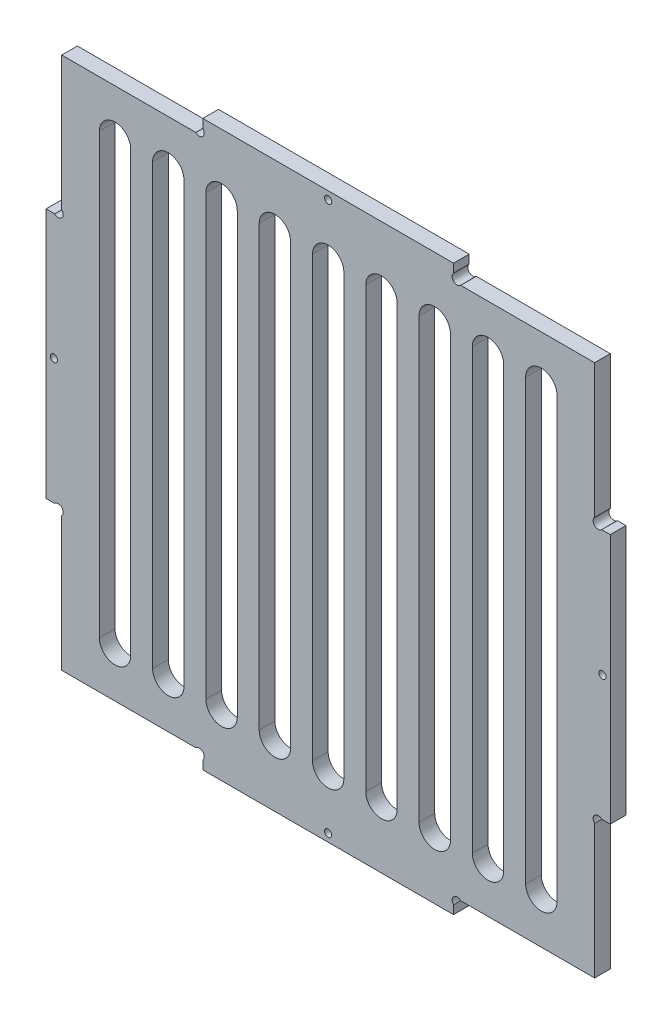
ISO-10303-21;
HEADER;
FILE_DESCRIPTION(('STEP AP214'),'2;1');
FILE_NAME('part.step','',(''),(''),'','','');
FILE_SCHEMA(('AUTOMOTIVE_DESIGN { 1 0 10303 214 1 1 1 1 }'));
ENDSEC;
DATA;
#1=APPLICATION_CONTEXT('core data for automotive mechanical design processes');
#2=APPLICATION_PROTOCOL_DEFINITION('international standard','automotive_design',2000,#1);
#3=PRODUCT_CONTEXT('',#1,'mechanical');
#4=PRODUCT('Part','Part','',(#3));
#5=PRODUCT_RELATED_PRODUCT_CATEGORY('part','',(#4));
#6=PRODUCT_DEFINITION_FORMATION('','',#4);
#7=PRODUCT_DEFINITION_CONTEXT('part definition',#1,'design');
#8=PRODUCT_DEFINITION('design','',#6,#7);
#9=PRODUCT_DEFINITION_SHAPE('','',#8);
#10=(LENGTH_UNIT() NAMED_UNIT(*) SI_UNIT(.MILLI.,.METRE.));
#11=(NAMED_UNIT(*) PLANE_ANGLE_UNIT() SI_UNIT($,.RADIAN.));
#12=(NAMED_UNIT(*) SI_UNIT($,.STERADIAN.) SOLID_ANGLE_UNIT());
#13=UNCERTAINTY_MEASURE_WITH_UNIT(LENGTH_MEASURE(1.E-05),#10,'distance_accuracy_value','');
#14=(GEOMETRIC_REPRESENTATION_CONTEXT(3) GLOBAL_UNCERTAINTY_ASSIGNED_CONTEXT((#13)) GLOBAL_UNIT_ASSIGNED_CONTEXT((#10,
#11,#12)) REPRESENTATION_CONTEXT('',''));
#15=CARTESIAN_POINT('',(0.,0.,0.));
#16=DIRECTION('',(0.,0.,1.));
#17=DIRECTION('',(1.,0.,0.));
#18=AXIS2_PLACEMENT_3D('',#15,#16,#17);
#19=CARTESIAN_POINT('',(0.,0.,5.));
#20=DIRECTION('',(1.,0.,0.));
#21=DIRECTION('',(0.,0.,-1.));
#22=AXIS2_PLACEMENT_3D('',#19,#20,#21);
#23=PLANE('',#22);
#24=DIRECTION('',(0.,-1.,0.));
#25=VECTOR('',#24,1.);
#26=CARTESIAN_POINT('',(0.,0.,5.));
#27=LINE('',#26,#25);
#28=CARTESIAN_POINT('',(0.,130.,5.));
#29=VERTEX_POINT('',#28);
#30=CARTESIAN_POINT('',(0.,50.,5.));
#31=VERTEX_POINT('',#30);
#32=EDGE_CURVE('E926',#29,#31,#27,.T.);
#33=ORIENTED_EDGE('',*,*,#32,.F.);
#34=DIRECTION('',(0.,0.,-1.));
#35=VECTOR('',#34,1.);
#36=CARTESIAN_POINT('',(0.,130.,5.));
#37=LINE('',#36,#35);
#38=CARTESIAN_POINT('',(0.,130.,0.));
#39=VERTEX_POINT('',#38);
#40=EDGE_CURVE('E822',#29,#39,#37,.T.);
#41=ORIENTED_EDGE('',*,*,#40,.T.);
#42=DIRECTION('',(0.,-1.,0.));
#43=VECTOR('',#42,1.);
#44=CARTESIAN_POINT('',(0.,0.,0.));
#45=LINE('',#44,#43);
#46=CARTESIAN_POINT('',(0.,50.,0.));
#47=VERTEX_POINT('',#46);
#48=EDGE_CURVE('E920',#39,#47,#45,.T.);
#49=ORIENTED_EDGE('',*,*,#48,.T.);
#50=DIRECTION('',(0.,0.,-1.));
#51=VECTOR('',#50,1.);
#52=CARTESIAN_POINT('',(0.,50.,5.));
#53=LINE('',#52,#51);
#54=EDGE_CURVE('E863',#31,#47,#53,.T.);
#55=ORIENTED_EDGE('',*,*,#54,.F.);
#56=EDGE_LOOP('',(#33,#41,#49,#55));
#57=FACE_BOUND('',#56,.T.);
#58=ADVANCED_FACE('F32',(#57),#23,.F.);
#59=CARTESIAN_POINT('',(0.,0.,5.));
#60=DIRECTION('',(0.,1.,0.));
#61=DIRECTION('',(0.,0.,1.));
#62=AXIS2_PLACEMENT_3D('',#59,#60,#61);
#63=PLANE('',#62);
#64=DIRECTION('',(1.,0.,0.));
#65=VECTOR('',#64,1.);
#66=CARTESIAN_POINT('',(0.,0.,5.));
#67=LINE('',#66,#65);
#68=CARTESIAN_POINT('',(50.,0.,5.));
#69=VERTEX_POINT('',#68);
#70=CARTESIAN_POINT('',(130.,0.,5.));
#71=VERTEX_POINT('',#70);
#72=EDGE_CURVE('E928',#69,#71,#67,.T.);
#73=ORIENTED_EDGE('',*,*,#72,.F.);
#74=DIRECTION('',(0.,0.,-1.));
#75=VECTOR('',#74,1.);
#76=CARTESIAN_POINT('',(50.,0.,5.));
#77=LINE('',#76,#75);
#78=CARTESIAN_POINT('',(50.,0.,0.));
#79=VERTEX_POINT('',#78);
#80=EDGE_CURVE('E850',#69,#79,#77,.T.);
#81=ORIENTED_EDGE('',*,*,#80,.T.);
#82=DIRECTION('',(1.,0.,0.));
#83=VECTOR('',#82,1.);
#84=CARTESIAN_POINT('',(0.,0.,0.));
#85=LINE('',#84,#83);
#86=CARTESIAN_POINT('',(130.,0.,0.));
#87=VERTEX_POINT('',#86);
#88=EDGE_CURVE('E938',#79,#87,#85,.T.);
#89=ORIENTED_EDGE('',*,*,#88,.T.);
#90=DIRECTION('',(0.,0.,-1.));
#91=VECTOR('',#90,1.);
#92=CARTESIAN_POINT('',(130.,0.,5.));
#93=LINE('',#92,#91);
#94=EDGE_CURVE('E892',#71,#87,#93,.T.);
#95=ORIENTED_EDGE('',*,*,#94,.F.);
#96=EDGE_LOOP('',(#73,#81,#89,#95));
#97=FACE_BOUND('',#96,.T.);
#98=ADVANCED_FACE('F1003',(#97),#63,.F.);
#99=CARTESIAN_POINT('',(180.,0.,5.));
#100=DIRECTION('',(-1.,0.,0.));
#101=DIRECTION('',(0.,0.,1.));
#102=AXIS2_PLACEMENT_3D('',#99,#100,#101);
#103=PLANE('',#102);
#104=DIRECTION('',(0.,1.,0.));
#105=VECTOR('',#104,1.);
#106=CARTESIAN_POINT('',(180.,0.,5.));
#107=LINE('',#106,#105);
#108=CARTESIAN_POINT('',(180.,50.,5.));
#109=VERTEX_POINT('',#108);
#110=CARTESIAN_POINT('',(180.,130.,5.));
#111=VERTEX_POINT('',#110);
#112=EDGE_CURVE('E931',#109,#111,#107,.T.);
#113=ORIENTED_EDGE('',*,*,#112,.F.);
#114=DIRECTION('',(0.,0.,-1.));
#115=VECTOR('',#114,1.);
#116=CARTESIAN_POINT('',(180.,50.,5.));
#117=LINE('',#116,#115);
#118=CARTESIAN_POINT('',(180.,50.,0.));
#119=VERTEX_POINT('',#118);
#120=EDGE_CURVE('E879',#109,#119,#117,.T.);
#121=ORIENTED_EDGE('',*,*,#120,.T.);
#122=DIRECTION('',(0.,1.,0.));
#123=VECTOR('',#122,1.);
#124=CARTESIAN_POINT('',(180.,0.,0.));
#125=LINE('',#124,#123);
#126=CARTESIAN_POINT('',(180.,130.,0.));
#127=VERTEX_POINT('',#126);
#128=EDGE_CURVE('E940',#119,#127,#125,.T.);
#129=ORIENTED_EDGE('',*,*,#128,.T.);
#130=DIRECTION('',(0.,0.,-1.));
#131=VECTOR('',#130,1.);
#132=CARTESIAN_POINT('',(180.,130.,5.));
#133=LINE('',#132,#131);
#134=EDGE_CURVE('E908',#111,#127,#133,.T.);
#135=ORIENTED_EDGE('',*,*,#134,.F.);
#136=EDGE_LOOP('',(#113,#121,#129,#135));
#137=FACE_BOUND('',#136,.T.);
#138=ADVANCED_FACE('F977',(#137),#103,.F.);
#139=CARTESIAN_POINT('',(0.,180.,5.));
#140=DIRECTION('',(0.,-1.,0.));
#141=DIRECTION('',(0.,0.,-1.));
#142=AXIS2_PLACEMENT_3D('',#139,#140,#141);
#143=PLANE('',#142);
#144=DIRECTION('',(-1.,0.,0.));
#145=VECTOR('',#144,1.);
#146=CARTESIAN_POINT('',(0.,180.,0.));
#147=LINE('',#146,#145);
#148=CARTESIAN_POINT('',(130.,180.,0.));
#149=VERTEX_POINT('',#148);
#150=CARTESIAN_POINT('',(50.,180.,0.));
#151=VERTEX_POINT('',#150);
#152=EDGE_CURVE('E929',#149,#151,#147,.T.);
#153=ORIENTED_EDGE('',*,*,#152,.T.);
#154=DIRECTION('',(0.,0.,-1.));
#155=VECTOR('',#154,1.);
#156=CARTESIAN_POINT('',(50.,180.,5.));
#157=LINE('',#156,#155);
#158=CARTESIAN_POINT('',(50.,180.,5.));
#159=VERTEX_POINT('',#158);
#160=EDGE_CURVE('E835',#159,#151,#157,.T.);
#161=ORIENTED_EDGE('',*,*,#160,.F.);
#162=DIRECTION('',(-1.,0.,0.));
#163=VECTOR('',#162,1.);
#164=CARTESIAN_POINT('',(0.,180.,5.));
#165=LINE('',#164,#163);
#166=CARTESIAN_POINT('',(130.,180.,5.));
#167=VERTEX_POINT('',#166);
#168=EDGE_CURVE('E933',#167,#159,#165,.T.);
#169=ORIENTED_EDGE('',*,*,#168,.F.);
#170=DIRECTION('',(0.,0.,-1.));
#171=VECTOR('',#170,1.);
#172=CARTESIAN_POINT('',(130.,180.,5.));
#173=LINE('',#172,#171);
#174=EDGE_CURVE('E917',#167,#149,#173,.T.);
#175=ORIENTED_EDGE('',*,*,#174,.T.);
#176=EDGE_LOOP('',(#153,#161,#169,#175));
#177=FACE_BOUND('',#176,.T.);
#178=ADVANCED_FACE('F1060',(#177),#143,.F.);
#179=CARTESIAN_POINT('',(0.,0.,5.));
#180=DIRECTION('',(0.,0.,-1.));
#181=DIRECTION('',(-1.,0.,0.));
#182=AXIS2_PLACEMENT_3D('',#179,#180,#181);
#183=PLANE('',#182);
#184=DIRECTION('',(0.,1.,0.));
#185=VECTOR('',#184,1.);
#186=CARTESIAN_POINT('',(153.,160.,5.));
#187=LINE('',#186,#185);
#188=CARTESIAN_POINT('',(153.,20.,5.));
#189=VERTEX_POINT('',#188);
#190=CARTESIAN_POINT('',(153.,160.,5.));
#191=VERTEX_POINT('',#190);
#192=EDGE_CURVE('E440',#189,#191,#187,.T.);
#193=ORIENTED_EDGE('',*,*,#192,.T.);
#194=CARTESIAN_POINT('',(158.,160.,5.));
#195=DIRECTION('',(0.,0.,-1.));
#196=DIRECTION('',(-1.,0.,0.));
#197=AXIS2_PLACEMENT_3D('',#194,#195,#196);
#198=CIRCLE('',#197,5.);
#199=CARTESIAN_POINT('',(163.,160.,5.));
#200=VERTEX_POINT('',#199);
#201=EDGE_CURVE('E434',#191,#200,#198,.T.);
#202=ORIENTED_EDGE('',*,*,#201,.T.);
#203=DIRECTION('',(0.,-1.,0.));
#204=VECTOR('',#203,1.);
#205=CARTESIAN_POINT('',(163.,160.,5.));
#206=LINE('',#205,#204);
#207=CARTESIAN_POINT('',(163.,20.,5.));
#208=VERTEX_POINT('',#207);
#209=EDGE_CURVE('E443',#200,#208,#206,.T.);
#210=ORIENTED_EDGE('',*,*,#209,.T.);
#211=CARTESIAN_POINT('',(158.,20.,5.));
#212=DIRECTION('',(0.,0.,-1.));
#213=DIRECTION('',(-1.,0.,0.));
#214=AXIS2_PLACEMENT_3D('',#211,#212,#213);
#215=CIRCLE('',#214,4.99999999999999);
#216=EDGE_CURVE('E46',#208,#189,#215,.T.);
#217=ORIENTED_EDGE('',*,*,#216,.T.);
#218=EDGE_LOOP('',(#193,#202,#210,#217));
#219=FACE_BOUND('',#218,.T.);
#220=DIRECTION('',(0.,1.,0.));
#221=VECTOR('',#220,1.);
#222=CARTESIAN_POINT('',(136.,160.,5.));
#223=LINE('',#222,#221);
#224=CARTESIAN_POINT('',(136.,20.,5.));
#225=VERTEX_POINT('',#224);
#226=CARTESIAN_POINT('',(136.,160.,5.));
#227=VERTEX_POINT('',#226);
#228=EDGE_CURVE('E479',#225,#227,#223,.T.);
#229=ORIENTED_EDGE('',*,*,#228,.T.);
#230=CARTESIAN_POINT('',(141.,160.,5.));
#231=DIRECTION('',(0.,0.,-1.));
#232=DIRECTION('',(-1.,0.,0.));
#233=AXIS2_PLACEMENT_3D('',#230,#231,#232);
#234=CIRCLE('',#233,5.);
#235=CARTESIAN_POINT('',(146.,160.,5.));
#236=VERTEX_POINT('',#235);
#237=EDGE_CURVE('E469',#227,#236,#234,.T.);
#238=ORIENTED_EDGE('',*,*,#237,.T.);
#239=DIRECTION('',(0.,-1.,0.));
#240=VECTOR('',#239,1.);
#241=CARTESIAN_POINT('',(146.,160.,5.));
#242=LINE('',#241,#240);
#243=CARTESIAN_POINT('',(146.,20.,5.));
#244=VERTEX_POINT('',#243);
#245=EDGE_CURVE('E472',#236,#244,#242,.T.);
#246=ORIENTED_EDGE('',*,*,#245,.T.);
#247=CARTESIAN_POINT('',(141.,20.,5.));
#248=DIRECTION('',(0.,0.,-1.));
#249=DIRECTION('',(-1.,0.,0.));
#250=AXIS2_PLACEMENT_3D('',#247,#248,#249);
#251=CIRCLE('',#250,4.99999999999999);
#252=EDGE_CURVE('E476',#244,#225,#251,.T.);
#253=ORIENTED_EDGE('',*,*,#252,.T.);
#254=EDGE_LOOP('',(#229,#238,#246,#253));
#255=FACE_BOUND('',#254,.T.);
#256=DIRECTION('',(0.,1.,0.));
#257=VECTOR('',#256,1.);
#258=CARTESIAN_POINT('',(119.,160.,5.));
#259=LINE('',#258,#257);
#260=CARTESIAN_POINT('',(119.,20.,5.));
#261=VERTEX_POINT('',#260);
#262=CARTESIAN_POINT('',(119.,160.,5.));
#263=VERTEX_POINT('',#262);
#264=EDGE_CURVE('E511',#261,#263,#259,.T.);
#265=ORIENTED_EDGE('',*,*,#264,.T.);
#266=CARTESIAN_POINT('',(124.,160.,5.));
#267=DIRECTION('',(0.,0.,-1.));
#268=DIRECTION('',(-1.,0.,0.));
#269=AXIS2_PLACEMENT_3D('',#266,#267,#268);
#270=CIRCLE('',#269,5.);
#271=CARTESIAN_POINT('',(129.,160.,5.));
#272=VERTEX_POINT('',#271);
#273=EDGE_CURVE('E501',#263,#272,#270,.T.);
#274=ORIENTED_EDGE('',*,*,#273,.T.);
#275=DIRECTION('',(0.,-1.,0.));
#276=VECTOR('',#275,1.);
#277=CARTESIAN_POINT('',(129.,160.,5.));
#278=LINE('',#277,#276);
#279=CARTESIAN_POINT('',(129.,20.,5.));
#280=VERTEX_POINT('',#279);
#281=EDGE_CURVE('E504',#272,#280,#278,.T.);
#282=ORIENTED_EDGE('',*,*,#281,.T.);
#283=CARTESIAN_POINT('',(124.,20.,5.));
#284=DIRECTION('',(0.,0.,-1.));
#285=DIRECTION('',(-1.,0.,0.));
#286=AXIS2_PLACEMENT_3D('',#283,#284,#285);
#287=CIRCLE('',#286,4.99999999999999);
#288=EDGE_CURVE('E508',#280,#261,#287,.T.);
#289=ORIENTED_EDGE('',*,*,#288,.T.);
#290=EDGE_LOOP('',(#265,#274,#282,#289));
#291=FACE_BOUND('',#290,.T.);
#292=DIRECTION('',(0.,1.,0.));
#293=VECTOR('',#292,1.);
#294=CARTESIAN_POINT('',(102.,160.,5.));
#295=LINE('',#294,#293);
#296=CARTESIAN_POINT('',(102.,20.,5.));
#297=VERTEX_POINT('',#296);
#298=CARTESIAN_POINT('',(102.,160.,5.));
#299=VERTEX_POINT('',#298);
#300=EDGE_CURVE('E543',#297,#299,#295,.T.);
#301=ORIENTED_EDGE('',*,*,#300,.T.);
#302=CARTESIAN_POINT('',(107.,160.,5.));
#303=DIRECTION('',(0.,0.,-1.));
#304=DIRECTION('',(-1.,0.,0.));
#305=AXIS2_PLACEMENT_3D('',#302,#303,#304);
#306=CIRCLE('',#305,5.);
#307=CARTESIAN_POINT('',(112.,160.,5.));
#308=VERTEX_POINT('',#307);
#309=EDGE_CURVE('E533',#299,#308,#306,.T.);
#310=ORIENTED_EDGE('',*,*,#309,.T.);
#311=DIRECTION('',(0.,-1.,0.));
#312=VECTOR('',#311,1.);
#313=CARTESIAN_POINT('',(112.,160.,5.));
#314=LINE('',#313,#312);
#315=CARTESIAN_POINT('',(112.,20.,5.));
#316=VERTEX_POINT('',#315);
#317=EDGE_CURVE('E536',#308,#316,#314,.T.);
#318=ORIENTED_EDGE('',*,*,#317,.T.);
#319=CARTESIAN_POINT('',(107.,20.,5.));
#320=DIRECTION('',(0.,0.,-1.));
#321=DIRECTION('',(-1.,0.,0.));
#322=AXIS2_PLACEMENT_3D('',#319,#320,#321);
#323=CIRCLE('',#322,4.99999999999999);
#324=EDGE_CURVE('E540',#316,#297,#323,.T.);
#325=ORIENTED_EDGE('',*,*,#324,.T.);
#326=EDGE_LOOP('',(#301,#310,#318,#325));
#327=FACE_BOUND('',#326,.T.);
#328=DIRECTION('',(0.,1.,0.));
#329=VECTOR('',#328,1.);
#330=CARTESIAN_POINT('',(17.,160.,5.));
#331=LINE('',#330,#329);
#332=CARTESIAN_POINT('',(17.,20.,5.));
#333=VERTEX_POINT('',#332);
#334=CARTESIAN_POINT('',(17.,160.,5.));
#335=VERTEX_POINT('',#334);
#336=EDGE_CURVE('E575',#333,#335,#331,.T.);
#337=ORIENTED_EDGE('',*,*,#336,.T.);
#338=CARTESIAN_POINT('',(22.,160.,5.));
#339=DIRECTION('',(0.,0.,-1.));
#340=DIRECTION('',(-1.,0.,0.));
#341=AXIS2_PLACEMENT_3D('',#338,#339,#340);
#342=CIRCLE('',#341,5.);
#343=CARTESIAN_POINT('',(27.,160.,5.));
#344=VERTEX_POINT('',#343);
#345=EDGE_CURVE('E565',#335,#344,#342,.T.);
#346=ORIENTED_EDGE('',*,*,#345,.T.);
#347=DIRECTION('',(0.,-1.,0.));
#348=VECTOR('',#347,1.);
#349=CARTESIAN_POINT('',(27.,160.,5.));
#350=LINE('',#349,#348);
#351=CARTESIAN_POINT('',(27.,20.,5.));
#352=VERTEX_POINT('',#351);
#353=EDGE_CURVE('E568',#344,#352,#350,.T.);
#354=ORIENTED_EDGE('',*,*,#353,.T.);
#355=CARTESIAN_POINT('',(22.,20.,5.));
#356=DIRECTION('',(0.,0.,-1.));
#357=DIRECTION('',(-1.,0.,0.));
#358=AXIS2_PLACEMENT_3D('',#355,#356,#357);
#359=CIRCLE('',#358,4.99999999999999);
#360=EDGE_CURVE('E572',#352,#333,#359,.T.);
#361=ORIENTED_EDGE('',*,*,#360,.T.);
#362=EDGE_LOOP('',(#337,#346,#354,#361));
#363=FACE_BOUND('',#362,.T.);
#364=DIRECTION('',(0.,1.,0.));
#365=VECTOR('',#364,1.);
#366=CARTESIAN_POINT('',(34.,160.,5.));
#367=LINE('',#366,#365);
#368=CARTESIAN_POINT('',(34.,20.,5.));
#369=VERTEX_POINT('',#368);
#370=CARTESIAN_POINT('',(34.,160.,5.));
#371=VERTEX_POINT('',#370);
#372=EDGE_CURVE('E607',#369,#371,#367,.T.);
#373=ORIENTED_EDGE('',*,*,#372,.T.);
#374=CARTESIAN_POINT('',(39.,160.,5.));
#375=DIRECTION('',(0.,0.,-1.));
#376=DIRECTION('',(-1.,0.,0.));
#377=AXIS2_PLACEMENT_3D('',#374,#375,#376);
#378=CIRCLE('',#377,5.);
#379=CARTESIAN_POINT('',(44.,160.,5.));
#380=VERTEX_POINT('',#379);
#381=EDGE_CURVE('E597',#371,#380,#378,.T.);
#382=ORIENTED_EDGE('',*,*,#381,.T.);
#383=DIRECTION('',(0.,-1.,0.));
#384=VECTOR('',#383,1.);
#385=CARTESIAN_POINT('',(44.,160.,5.));
#386=LINE('',#385,#384);
#387=CARTESIAN_POINT('',(44.,20.,5.));
#388=VERTEX_POINT('',#387);
#389=EDGE_CURVE('E600',#380,#388,#386,.T.);
#390=ORIENTED_EDGE('',*,*,#389,.T.);
#391=CARTESIAN_POINT('',(39.,20.,5.));
#392=DIRECTION('',(0.,0.,-1.));
#393=DIRECTION('',(-1.,0.,0.));
#394=AXIS2_PLACEMENT_3D('',#391,#392,#393);
#395=CIRCLE('',#394,4.99999999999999);
#396=EDGE_CURVE('E604',#388,#369,#395,.T.);
#397=ORIENTED_EDGE('',*,*,#396,.T.);
#398=EDGE_LOOP('',(#373,#382,#390,#397));
#399=FACE_BOUND('',#398,.T.);
#400=DIRECTION('',(0.,1.,0.));
#401=VECTOR('',#400,1.);
#402=CARTESIAN_POINT('',(51.,160.,5.));
#403=LINE('',#402,#401);
#404=CARTESIAN_POINT('',(51.,20.,5.));
#405=VERTEX_POINT('',#404);
#406=CARTESIAN_POINT('',(51.,160.,5.));
#407=VERTEX_POINT('',#406);
#408=EDGE_CURVE('E639',#405,#407,#403,.T.);
#409=ORIENTED_EDGE('',*,*,#408,.T.);
#410=CARTESIAN_POINT('',(56.,160.,5.));
#411=DIRECTION('',(0.,0.,-1.));
#412=DIRECTION('',(-1.,0.,0.));
#413=AXIS2_PLACEMENT_3D('',#410,#411,#412);
#414=CIRCLE('',#413,5.);
#415=CARTESIAN_POINT('',(61.,160.,5.));
#416=VERTEX_POINT('',#415);
#417=EDGE_CURVE('E629',#407,#416,#414,.T.);
#418=ORIENTED_EDGE('',*,*,#417,.T.);
#419=DIRECTION('',(0.,-1.,0.));
#420=VECTOR('',#419,1.);
#421=CARTESIAN_POINT('',(61.,160.,5.));
#422=LINE('',#421,#420);
#423=CARTESIAN_POINT('',(61.,20.,5.));
#424=VERTEX_POINT('',#423);
#425=EDGE_CURVE('E632',#416,#424,#422,.T.);
#426=ORIENTED_EDGE('',*,*,#425,.T.);
#427=CARTESIAN_POINT('',(56.,20.,5.));
#428=DIRECTION('',(0.,0.,-1.));
#429=DIRECTION('',(-1.,0.,0.));
#430=AXIS2_PLACEMENT_3D('',#427,#428,#429);
#431=CIRCLE('',#430,4.99999999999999);
#432=EDGE_CURVE('E636',#424,#405,#431,.T.);
#433=ORIENTED_EDGE('',*,*,#432,.T.);
#434=EDGE_LOOP('',(#409,#418,#426,#433));
#435=FACE_BOUND('',#434,.T.);
#436=DIRECTION('',(0.,1.,0.));
#437=VECTOR('',#436,1.);
#438=CARTESIAN_POINT('',(68.,160.,5.));
#439=LINE('',#438,#437);
#440=CARTESIAN_POINT('',(68.,20.,5.));
#441=VERTEX_POINT('',#440);
#442=CARTESIAN_POINT('',(68.,160.,5.));
#443=VERTEX_POINT('',#442);
#444=EDGE_CURVE('E671',#441,#443,#439,.T.);
#445=ORIENTED_EDGE('',*,*,#444,.T.);
#446=CARTESIAN_POINT('',(73.,160.,5.));
#447=DIRECTION('',(0.,0.,-1.));
#448=DIRECTION('',(-1.,0.,0.));
#449=AXIS2_PLACEMENT_3D('',#446,#447,#448);
#450=CIRCLE('',#449,5.);
#451=CARTESIAN_POINT('',(78.,160.,5.));
#452=VERTEX_POINT('',#451);
#453=EDGE_CURVE('E661',#443,#452,#450,.T.);
#454=ORIENTED_EDGE('',*,*,#453,.T.);
#455=DIRECTION('',(0.,-1.,0.));
#456=VECTOR('',#455,1.);
#457=CARTESIAN_POINT('',(78.,160.,5.));
#458=LINE('',#457,#456);
#459=CARTESIAN_POINT('',(78.,20.,5.));
#460=VERTEX_POINT('',#459);
#461=EDGE_CURVE('E664',#452,#460,#458,.T.);
#462=ORIENTED_EDGE('',*,*,#461,.T.);
#463=CARTESIAN_POINT('',(73.,20.,5.));
#464=DIRECTION('',(0.,0.,-1.));
#465=DIRECTION('',(-1.,0.,0.));
#466=AXIS2_PLACEMENT_3D('',#463,#464,#465);
#467=CIRCLE('',#466,4.99999999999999);
#468=EDGE_CURVE('E668',#460,#441,#467,.T.);
#469=ORIENTED_EDGE('',*,*,#468,.T.);
#470=EDGE_LOOP('',(#445,#454,#462,#469));
#471=FACE_BOUND('',#470,.T.);
#472=DIRECTION('',(0.,1.,0.));
#473=VECTOR('',#472,1.);
#474=CARTESIAN_POINT('',(85.,160.,5.));
#475=LINE('',#474,#473);
#476=CARTESIAN_POINT('',(85.,20.,5.));
#477=VERTEX_POINT('',#476);
#478=CARTESIAN_POINT('',(85.,160.,5.));
#479=VERTEX_POINT('',#478);
#480=EDGE_CURVE('E703',#477,#479,#475,.T.);
#481=ORIENTED_EDGE('',*,*,#480,.T.);
#482=CARTESIAN_POINT('',(90.,160.,5.));
#483=DIRECTION('',(0.,0.,-1.));
#484=DIRECTION('',(-1.,0.,0.));
#485=AXIS2_PLACEMENT_3D('',#482,#483,#484);
#486=CIRCLE('',#485,5.);
#487=CARTESIAN_POINT('',(95.,160.,5.));
#488=VERTEX_POINT('',#487);
#489=EDGE_CURVE('E693',#479,#488,#486,.T.);
#490=ORIENTED_EDGE('',*,*,#489,.T.);
#491=DIRECTION('',(0.,-1.,0.));
#492=VECTOR('',#491,1.);
#493=CARTESIAN_POINT('',(95.,160.,5.));
#494=LINE('',#493,#492);
#495=CARTESIAN_POINT('',(95.,20.,5.));
#496=VERTEX_POINT('',#495);
#497=EDGE_CURVE('E696',#488,#496,#494,.T.);
#498=ORIENTED_EDGE('',*,*,#497,.T.);
#499=CARTESIAN_POINT('',(90.,20.,5.));
#500=DIRECTION('',(0.,0.,-1.));
#501=DIRECTION('',(-1.,0.,0.));
#502=AXIS2_PLACEMENT_3D('',#499,#500,#501);
#503=CIRCLE('',#502,4.99999999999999);
#504=EDGE_CURVE('E700',#496,#477,#503,.T.);
#505=ORIENTED_EDGE('',*,*,#504,.T.);
#506=EDGE_LOOP('',(#481,#490,#498,#505));
#507=FACE_BOUND('',#506,.T.);
#508=CARTESIAN_POINT('',(177.5,90.,5.));
#509=DIRECTION('',(0.,0.,-1.));
#510=DIRECTION('',(1.,0.,0.));
#511=AXIS2_PLACEMENT_3D('',#508,#509,#510);
#512=CIRCLE('',#511,1.15000000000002);
#513=CARTESIAN_POINT('',(178.65,90.,5.));
#514=VERTEX_POINT('',#513);
#515=EDGE_CURVE('E725',#514,#514,#512,.T.);
#516=ORIENTED_EDGE('',*,*,#515,.T.);
#517=EDGE_LOOP('',(#516));
#518=FACE_BOUND('',#517,.T.);
#519=CARTESIAN_POINT('',(89.9999999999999,2.50000000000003,5.));
#520=DIRECTION('',(0.,0.,-1.));
#521=DIRECTION('',(-1.,0.,0.));
#522=AXIS2_PLACEMENT_3D('',#519,#520,#521);
#523=CIRCLE('',#522,1.15);
#524=CARTESIAN_POINT('',(88.8499999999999,2.50000000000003,5.));
#525=VERTEX_POINT('',#524);
#526=EDGE_CURVE('E731',#525,#525,#523,.T.);
#527=ORIENTED_EDGE('',*,*,#526,.T.);
#528=EDGE_LOOP('',(#527));
#529=FACE_BOUND('',#528,.T.);
#530=CARTESIAN_POINT('',(2.50000000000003,89.9999999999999,5.));
#531=DIRECTION('',(0.,0.,-1.));
#532=DIRECTION('',(1.,0.,0.));
#533=AXIS2_PLACEMENT_3D('',#530,#531,#532);
#534=CIRCLE('',#533,1.15);
#535=CARTESIAN_POINT('',(3.65000000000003,89.9999999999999,5.));
#536=VERTEX_POINT('',#535);
#537=EDGE_CURVE('E737',#536,#536,#534,.T.);
#538=ORIENTED_EDGE('',*,*,#537,.T.);
#539=EDGE_LOOP('',(#538));
#540=FACE_BOUND('',#539,.T.);
#541=CARTESIAN_POINT('',(90.,177.5,5.));
#542=DIRECTION('',(0.,0.,-1.));
#543=DIRECTION('',(-1.,0.,0.));
#544=AXIS2_PLACEMENT_3D('',#541,#542,#543);
#545=CIRCLE('',#544,1.15000000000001);
#546=CARTESIAN_POINT('',(88.85,177.5,5.));
#547=VERTEX_POINT('',#546);
#548=EDGE_CURVE('E743',#547,#547,#545,.T.);
#549=ORIENTED_EDGE('',*,*,#548,.T.);
#550=EDGE_LOOP('',(#549));
#551=FACE_BOUND('',#550,.T.);
#552=DIRECTION('',(-1.,0.,0.));
#553=VECTOR('',#552,1.);
#554=CARTESIAN_POINT('',(180.,130.,5.));
#555=LINE('',#554,#553);
#556=CARTESIAN_POINT('',(177.262741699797,130.,5.));
#557=VERTEX_POINT('',#556);
#558=EDGE_CURVE('E897',#111,#557,#555,.T.);
#559=ORIENTED_EDGE('',*,*,#558,.T.);
#560=CARTESIAN_POINT('',(176.131370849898,131.131370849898,5.));
#561=DIRECTION('',(0.,0.,-1.));
#562=DIRECTION('',(1.,0.,0.));
#563=AXIS2_PLACEMENT_3D('',#560,#561,#562);
#564=CIRCLE('',#563,1.6);
#565=CARTESIAN_POINT('',(175.,132.262741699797,5.));
#566=VERTEX_POINT('',#565);
#567=EDGE_CURVE('E749',#557,#566,#564,.T.);
#568=ORIENTED_EDGE('',*,*,#567,.T.);
#569=DIRECTION('',(0.,1.,0.));
#570=VECTOR('',#569,1.);
#571=CARTESIAN_POINT('',(175.,175.,5.));
#572=LINE('',#571,#570);
#573=CARTESIAN_POINT('',(175.,175.,5.));
#574=VERTEX_POINT('',#573);
#575=EDGE_CURVE('E900',#566,#574,#572,.T.);
#576=ORIENTED_EDGE('',*,*,#575,.T.);
#577=DIRECTION('',(-1.,0.,0.));
#578=VECTOR('',#577,1.);
#579=CARTESIAN_POINT('',(130.,175.,5.));
#580=LINE('',#579,#578);
#581=CARTESIAN_POINT('',(132.262741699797,175.,5.));
#582=VERTEX_POINT('',#581);
#583=EDGE_CURVE('E903',#574,#582,#580,.T.);
#584=ORIENTED_EDGE('',*,*,#583,.T.);
#585=CARTESIAN_POINT('',(131.131370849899,176.131370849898,5.));
#586=DIRECTION('',(0.,0.,-1.));
#587=DIRECTION('',(-1.,0.,0.));
#588=AXIS2_PLACEMENT_3D('',#585,#586,#587);
#589=CIRCLE('',#588,1.59999999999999);
#590=CARTESIAN_POINT('',(130.,177.262741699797,5.));
#591=VERTEX_POINT('',#590);
#592=EDGE_CURVE('E803',#582,#591,#589,.T.);
#593=ORIENTED_EDGE('',*,*,#592,.T.);
#594=DIRECTION('',(0.,1.,0.));
#595=VECTOR('',#594,1.);
#596=CARTESIAN_POINT('',(130.,180.,5.));
#597=LINE('',#596,#595);
#598=EDGE_CURVE('E906',#591,#167,#597,.T.);
#599=ORIENTED_EDGE('',*,*,#598,.T.);
#600=ORIENTED_EDGE('',*,*,#168,.T.);
#601=DIRECTION('',(0.,-1.,0.));
#602=VECTOR('',#601,1.);
#603=CARTESIAN_POINT('',(50.,180.,5.));
#604=LINE('',#603,#602);
#605=CARTESIAN_POINT('',(50.,177.262741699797,5.));
#606=VERTEX_POINT('',#605);
#607=EDGE_CURVE('E813',#159,#606,#604,.T.);
#608=ORIENTED_EDGE('',*,*,#607,.T.);
#609=CARTESIAN_POINT('',(48.8686291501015,176.131370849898,5.));
#610=DIRECTION('',(0.,0.,-1.));
#611=DIRECTION('',(1.,0.,0.));
#612=AXIS2_PLACEMENT_3D('',#609,#610,#611);
#613=CIRCLE('',#612,1.59999999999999);
#614=CARTESIAN_POINT('',(47.7372583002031,175.,5.));
#615=VERTEX_POINT('',#614);
#616=EDGE_CURVE('E795',#606,#615,#613,.T.);
#617=ORIENTED_EDGE('',*,*,#616,.T.);
#618=DIRECTION('',(-1.,0.,0.));
#619=VECTOR('',#618,1.);
#620=CARTESIAN_POINT('',(50.,175.,5.));
#621=LINE('',#620,#619);
#622=CARTESIAN_POINT('',(4.99999999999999,175.,5.));
#623=VERTEX_POINT('',#622);
#624=EDGE_CURVE('E817',#615,#623,#621,.T.);
#625=ORIENTED_EDGE('',*,*,#624,.T.);
#626=DIRECTION('',(0.,-1.,0.));
#627=VECTOR('',#626,1.);
#628=CARTESIAN_POINT('',(4.99999999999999,175.,5.));
#629=LINE('',#628,#627);
#630=CARTESIAN_POINT('',(4.99999999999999,132.262741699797,5.));
#631=VERTEX_POINT('',#630);
#632=EDGE_CURVE('E819',#623,#631,#629,.T.);
#633=ORIENTED_EDGE('',*,*,#632,.T.);
#634=CARTESIAN_POINT('',(3.86862915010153,131.131370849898,5.));
#635=DIRECTION('',(0.,0.,-1.));
#636=DIRECTION('',(-1.,0.,0.));
#637=AXIS2_PLACEMENT_3D('',#634,#635,#636);
#638=CIRCLE('',#637,1.59999999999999);
#639=CARTESIAN_POINT('',(2.73725830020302,130.,5.));
#640=VERTEX_POINT('',#639);
#641=EDGE_CURVE('E787',#631,#640,#638,.T.);
#642=ORIENTED_EDGE('',*,*,#641,.T.);
#643=DIRECTION('',(-1.,0.,0.));
#644=VECTOR('',#643,1.);
#645=CARTESIAN_POINT('',(0.,130.,5.));
#646=LINE('',#645,#644);
#647=EDGE_CURVE('E811',#640,#29,#646,.T.);
#648=ORIENTED_EDGE('',*,*,#647,.T.);
#649=ORIENTED_EDGE('',*,*,#32,.T.);
#650=DIRECTION('',(1.,0.,0.));
#651=VECTOR('',#650,1.);
#652=CARTESIAN_POINT('',(0.,50.,5.));
#653=LINE('',#652,#651);
#654=CARTESIAN_POINT('',(2.73725830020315,50.,5.));
#655=VERTEX_POINT('',#654);
#656=EDGE_CURVE('E845',#31,#655,#653,.T.);
#657=ORIENTED_EDGE('',*,*,#656,.T.);
#658=CARTESIAN_POINT('',(3.86862915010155,48.8686291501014,5.));
#659=DIRECTION('',(0.,0.,-1.));
#660=DIRECTION('',(1.,0.,0.));
#661=AXIS2_PLACEMENT_3D('',#658,#659,#660);
#662=CIRCLE('',#661,1.60000000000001);
#663=CARTESIAN_POINT('',(4.99999999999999,47.7372583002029,5.));
#664=VERTEX_POINT('',#663);
#665=EDGE_CURVE('E779',#655,#664,#662,.T.);
#666=ORIENTED_EDGE('',*,*,#665,.T.);
#667=DIRECTION('',(0.,-1.,0.));
#668=VECTOR('',#667,1.);
#669=CARTESIAN_POINT('',(4.99999999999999,50.,5.));
#670=LINE('',#669,#668);
#671=CARTESIAN_POINT('',(4.99999999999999,5.,5.));
#672=VERTEX_POINT('',#671);
#673=EDGE_CURVE('E848',#664,#672,#670,.T.);
#674=ORIENTED_EDGE('',*,*,#673,.T.);
#675=DIRECTION('',(1.,0.,0.));
#676=VECTOR('',#675,1.);
#677=CARTESIAN_POINT('',(4.99999999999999,5.,5.));
#678=LINE('',#677,#676);
#679=CARTESIAN_POINT('',(47.7372583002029,5.,5.));
#680=VERTEX_POINT('',#679);
#681=EDGE_CURVE('E839',#672,#680,#678,.T.);
#682=ORIENTED_EDGE('',*,*,#681,.T.);
#683=CARTESIAN_POINT('',(48.8686291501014,3.86862915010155,5.));
#684=DIRECTION('',(0.,0.,-1.));
#685=DIRECTION('',(-1.,0.,0.));
#686=AXIS2_PLACEMENT_3D('',#683,#684,#685);
#687=CIRCLE('',#686,1.59999999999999);
#688=CARTESIAN_POINT('',(50.,2.73725830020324,5.));
#689=VERTEX_POINT('',#688);
#690=EDGE_CURVE('E772',#680,#689,#687,.T.);
#691=ORIENTED_EDGE('',*,*,#690,.T.);
#692=DIRECTION('',(0.,-1.,0.));
#693=VECTOR('',#692,1.);
#694=CARTESIAN_POINT('',(50.,0.,5.));
#695=LINE('',#694,#693);
#696=EDGE_CURVE('E842',#689,#69,#695,.T.);
#697=ORIENTED_EDGE('',*,*,#696,.T.);
#698=ORIENTED_EDGE('',*,*,#72,.T.);
#699=DIRECTION('',(0.,1.,0.));
#700=VECTOR('',#699,1.);
#701=CARTESIAN_POINT('',(130.,0.,5.));
#702=LINE('',#701,#700);
#703=CARTESIAN_POINT('',(130.,2.73725830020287,5.));
#704=VERTEX_POINT('',#703);
#705=EDGE_CURVE('E874',#71,#704,#702,.T.);
#706=ORIENTED_EDGE('',*,*,#705,.T.);
#707=CARTESIAN_POINT('',(131.131370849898,3.86862915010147,5.));
#708=DIRECTION('',(0.,0.,-1.));
#709=DIRECTION('',(1.,0.,0.));
#710=AXIS2_PLACEMENT_3D('',#707,#708,#709);
#711=CIRCLE('',#710,1.59999999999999);
#712=CARTESIAN_POINT('',(132.262741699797,5.,5.));
#713=VERTEX_POINT('',#712);
#714=EDGE_CURVE('E764',#704,#713,#711,.T.);
#715=ORIENTED_EDGE('',*,*,#714,.T.);
#716=DIRECTION('',(1.,0.,0.));
#717=VECTOR('',#716,1.);
#718=CARTESIAN_POINT('',(175.,5.,5.));
#719=LINE('',#718,#717);
#720=CARTESIAN_POINT('',(175.,5.,5.));
#721=VERTEX_POINT('',#720);
#722=EDGE_CURVE('E877',#713,#721,#719,.T.);
#723=ORIENTED_EDGE('',*,*,#722,.T.);
#724=DIRECTION('',(0.,1.,0.));
#725=VECTOR('',#724,1.);
#726=CARTESIAN_POINT('',(175.,50.,5.));
#727=LINE('',#726,#725);
#728=CARTESIAN_POINT('',(175.,47.737258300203,5.));
#729=VERTEX_POINT('',#728);
#730=EDGE_CURVE('E868',#721,#729,#727,.T.);
#731=ORIENTED_EDGE('',*,*,#730,.T.);
#732=CARTESIAN_POINT('',(176.131370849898,48.8686291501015,5.));
#733=DIRECTION('',(0.,0.,-1.));
#734=DIRECTION('',(-1.,0.,0.));
#735=AXIS2_PLACEMENT_3D('',#732,#733,#734);
#736=CIRCLE('',#735,1.59999999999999);
#737=CARTESIAN_POINT('',(177.262741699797,50.,5.));
#738=VERTEX_POINT('',#737);
#739=EDGE_CURVE('E757',#729,#738,#736,.T.);
#740=ORIENTED_EDGE('',*,*,#739,.T.);
#741=DIRECTION('',(1.,0.,0.));
#742=VECTOR('',#741,1.);
#743=CARTESIAN_POINT('',(180.,50.,5.));
#744=LINE('',#743,#742);
#745=EDGE_CURVE('E871',#738,#109,#744,.T.);
#746=ORIENTED_EDGE('',*,*,#745,.T.);
#747=ORIENTED_EDGE('',*,*,#112,.T.);
#748=EDGE_LOOP('',(#559,#568,#576,#584,#593,#599,#600,#608,#617,#625,#633,#642,#648,#649,#657,
#666,#674,#682,#691,#697,#698,#706,#715,#723,#731,#740,#746,#747));
#749=FACE_BOUND('',#748,.T.);
#750=ADVANCED_FACE('F447',(#219,#255,#291,#327,#363,#399,#435,#471,#507,#518,#529,#540,#551,
#749),#183,.F.);
#751=CARTESIAN_POINT('',(0.,0.,0.));
#752=DIRECTION('',(0.,0.,-1.));
#753=DIRECTION('',(-1.,0.,0.));
#754=AXIS2_PLACEMENT_3D('',#751,#752,#753);
#755=PLANE('',#754);
#756=CARTESIAN_POINT('',(158.,160.,0.));
#757=DIRECTION('',(0.,0.,-1.));
#758=DIRECTION('',(-1.,0.,0.));
#759=AXIS2_PLACEMENT_3D('',#756,#757,#758);
#760=CIRCLE('',#759,5.);
#761=CARTESIAN_POINT('',(153.,160.,0.));
#762=VERTEX_POINT('',#761);
#763=CARTESIAN_POINT('',(163.,160.,0.));
#764=VERTEX_POINT('',#763);
#765=EDGE_CURVE('E54',#762,#764,#760,.T.);
#766=ORIENTED_EDGE('',*,*,#765,.F.);
#767=DIRECTION('',(0.,1.,0.));
#768=VECTOR('',#767,1.);
#769=CARTESIAN_POINT('',(153.,160.,0.));
#770=LINE('',#769,#768);
#771=CARTESIAN_POINT('',(153.,20.,0.));
#772=VERTEX_POINT('',#771);
#773=EDGE_CURVE('E450',#772,#762,#770,.T.);
#774=ORIENTED_EDGE('',*,*,#773,.F.);
#775=CARTESIAN_POINT('',(158.,20.,0.));
#776=DIRECTION('',(0.,0.,-1.));
#777=DIRECTION('',(-1.,0.,0.));
#778=AXIS2_PLACEMENT_3D('',#775,#776,#777);
#779=CIRCLE('',#778,4.99999999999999);
#780=CARTESIAN_POINT('',(163.,20.,0.));
#781=VERTEX_POINT('',#780);
#782=EDGE_CURVE('E453',#781,#772,#779,.T.);
#783=ORIENTED_EDGE('',*,*,#782,.F.);
#784=DIRECTION('',(0.,-1.,0.));
#785=VECTOR('',#784,1.);
#786=CARTESIAN_POINT('',(163.,160.,0.));
#787=LINE('',#786,#785);
#788=EDGE_CURVE('E459',#764,#781,#787,.T.);
#789=ORIENTED_EDGE('',*,*,#788,.F.);
#790=EDGE_LOOP('',(#766,#774,#783,#789));
#791=FACE_BOUND('',#790,.T.);
#792=CARTESIAN_POINT('',(141.,160.,0.));
#793=DIRECTION('',(0.,0.,-1.));
#794=DIRECTION('',(-1.,0.,0.));
#795=AXIS2_PLACEMENT_3D('',#792,#793,#794);
#796=CIRCLE('',#795,5.);
#797=CARTESIAN_POINT('',(136.,160.,0.));
#798=VERTEX_POINT('',#797);
#799=CARTESIAN_POINT('',(146.,160.,0.));
#800=VERTEX_POINT('',#799);
#801=EDGE_CURVE('E465',#798,#800,#796,.T.);
#802=ORIENTED_EDGE('',*,*,#801,.F.);
#803=DIRECTION('',(0.,1.,0.));
#804=VECTOR('',#803,1.);
#805=CARTESIAN_POINT('',(136.,160.,0.));
#806=LINE('',#805,#804);
#807=CARTESIAN_POINT('',(136.,20.,0.));
#808=VERTEX_POINT('',#807);
#809=EDGE_CURVE('E473',#808,#798,#806,.T.);
#810=ORIENTED_EDGE('',*,*,#809,.F.);
#811=CARTESIAN_POINT('',(141.,20.,0.));
#812=DIRECTION('',(0.,0.,-1.));
#813=DIRECTION('',(-1.,0.,0.));
#814=AXIS2_PLACEMENT_3D('',#811,#812,#813);
#815=CIRCLE('',#814,4.99999999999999);
#816=CARTESIAN_POINT('',(146.,20.,0.));
#817=VERTEX_POINT('',#816);
#818=EDGE_CURVE('E487',#817,#808,#815,.T.);
#819=ORIENTED_EDGE('',*,*,#818,.F.);
#820=DIRECTION('',(0.,-1.,0.));
#821=VECTOR('',#820,1.);
#822=CARTESIAN_POINT('',(146.,160.,0.));
#823=LINE('',#822,#821);
#824=EDGE_CURVE('E484',#800,#817,#823,.T.);
#825=ORIENTED_EDGE('',*,*,#824,.F.);
#826=EDGE_LOOP('',(#802,#810,#819,#825));
#827=FACE_BOUND('',#826,.T.);
#828=CARTESIAN_POINT('',(124.,160.,0.));
#829=DIRECTION('',(0.,0.,-1.));
#830=DIRECTION('',(-1.,0.,0.));
#831=AXIS2_PLACEMENT_3D('',#828,#829,#830);
#832=CIRCLE('',#831,5.);
#833=CARTESIAN_POINT('',(119.,160.,0.));
#834=VERTEX_POINT('',#833);
#835=CARTESIAN_POINT('',(129.,160.,0.));
#836=VERTEX_POINT('',#835);
#837=EDGE_CURVE('E494',#834,#836,#832,.T.);
#838=ORIENTED_EDGE('',*,*,#837,.F.);
#839=DIRECTION('',(0.,1.,0.));
#840=VECTOR('',#839,1.);
#841=CARTESIAN_POINT('',(119.,160.,0.));
#842=LINE('',#841,#840);
#843=CARTESIAN_POINT('',(119.,20.,0.));
#844=VERTEX_POINT('',#843);
#845=EDGE_CURVE('E505',#844,#834,#842,.T.);
#846=ORIENTED_EDGE('',*,*,#845,.F.);
#847=CARTESIAN_POINT('',(124.,20.,0.));
#848=DIRECTION('',(0.,0.,-1.));
#849=DIRECTION('',(-1.,0.,0.));
#850=AXIS2_PLACEMENT_3D('',#847,#848,#849);
#851=CIRCLE('',#850,4.99999999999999);
#852=CARTESIAN_POINT('',(129.,20.,0.));
#853=VERTEX_POINT('',#852);
#854=EDGE_CURVE('E519',#853,#844,#851,.T.);
#855=ORIENTED_EDGE('',*,*,#854,.F.);
#856=DIRECTION('',(0.,-1.,0.));
#857=VECTOR('',#856,1.);
#858=CARTESIAN_POINT('',(129.,160.,0.));
#859=LINE('',#858,#857);
#860=EDGE_CURVE('E516',#836,#853,#859,.T.);
#861=ORIENTED_EDGE('',*,*,#860,.F.);
#862=EDGE_LOOP('',(#838,#846,#855,#861));
#863=FACE_BOUND('',#862,.T.);
#864=CARTESIAN_POINT('',(107.,160.,0.));
#865=DIRECTION('',(0.,0.,-1.));
#866=DIRECTION('',(-1.,0.,0.));
#867=AXIS2_PLACEMENT_3D('',#864,#865,#866);
#868=CIRCLE('',#867,5.);
#869=CARTESIAN_POINT('',(102.,160.,0.));
#870=VERTEX_POINT('',#869);
#871=CARTESIAN_POINT('',(112.,160.,0.));
#872=VERTEX_POINT('',#871);
#873=EDGE_CURVE('E526',#870,#872,#868,.T.);
#874=ORIENTED_EDGE('',*,*,#873,.F.);
#875=DIRECTION('',(0.,1.,0.));
#876=VECTOR('',#875,1.);
#877=CARTESIAN_POINT('',(102.,160.,0.));
#878=LINE('',#877,#876);
#879=CARTESIAN_POINT('',(102.,20.,0.));
#880=VERTEX_POINT('',#879);
#881=EDGE_CURVE('E537',#880,#870,#878,.T.);
#882=ORIENTED_EDGE('',*,*,#881,.F.);
#883=CARTESIAN_POINT('',(107.,20.,0.));
#884=DIRECTION('',(0.,0.,-1.));
#885=DIRECTION('',(-1.,0.,0.));
#886=AXIS2_PLACEMENT_3D('',#883,#884,#885);
#887=CIRCLE('',#886,4.99999999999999);
#888=CARTESIAN_POINT('',(112.,20.,0.));
#889=VERTEX_POINT('',#888);
#890=EDGE_CURVE('E551',#889,#880,#887,.T.);
#891=ORIENTED_EDGE('',*,*,#890,.F.);
#892=DIRECTION('',(0.,-1.,0.));
#893=VECTOR('',#892,1.);
#894=CARTESIAN_POINT('',(112.,160.,0.));
#895=LINE('',#894,#893);
#896=EDGE_CURVE('E548',#872,#889,#895,.T.);
#897=ORIENTED_EDGE('',*,*,#896,.F.);
#898=EDGE_LOOP('',(#874,#882,#891,#897));
#899=FACE_BOUND('',#898,.T.);
#900=CARTESIAN_POINT('',(22.,160.,0.));
#901=DIRECTION('',(0.,0.,-1.));
#902=DIRECTION('',(-1.,0.,0.));
#903=AXIS2_PLACEMENT_3D('',#900,#901,#902);
#904=CIRCLE('',#903,5.);
#905=CARTESIAN_POINT('',(17.,160.,0.));
#906=VERTEX_POINT('',#905);
#907=CARTESIAN_POINT('',(27.,160.,0.));
#908=VERTEX_POINT('',#907);
#909=EDGE_CURVE('E558',#906,#908,#904,.T.);
#910=ORIENTED_EDGE('',*,*,#909,.F.);
#911=DIRECTION('',(0.,1.,0.));
#912=VECTOR('',#911,1.);
#913=CARTESIAN_POINT('',(17.,160.,0.));
#914=LINE('',#913,#912);
#915=CARTESIAN_POINT('',(17.,20.,0.));
#916=VERTEX_POINT('',#915);
#917=EDGE_CURVE('E569',#916,#906,#914,.T.);
#918=ORIENTED_EDGE('',*,*,#917,.F.);
#919=CARTESIAN_POINT('',(22.,20.,0.));
#920=DIRECTION('',(0.,0.,-1.));
#921=DIRECTION('',(-1.,0.,0.));
#922=AXIS2_PLACEMENT_3D('',#919,#920,#921);
#923=CIRCLE('',#922,4.99999999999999);
#924=CARTESIAN_POINT('',(27.,20.,0.));
#925=VERTEX_POINT('',#924);
#926=EDGE_CURVE('E583',#925,#916,#923,.T.);
#927=ORIENTED_EDGE('',*,*,#926,.F.);
#928=DIRECTION('',(0.,-1.,0.));
#929=VECTOR('',#928,1.);
#930=CARTESIAN_POINT('',(27.,160.,0.));
#931=LINE('',#930,#929);
#932=EDGE_CURVE('E580',#908,#925,#931,.T.);
#933=ORIENTED_EDGE('',*,*,#932,.F.);
#934=EDGE_LOOP('',(#910,#918,#927,#933));
#935=FACE_BOUND('',#934,.T.);
#936=CARTESIAN_POINT('',(39.,160.,0.));
#937=DIRECTION('',(0.,0.,-1.));
#938=DIRECTION('',(-1.,0.,0.));
#939=AXIS2_PLACEMENT_3D('',#936,#937,#938);
#940=CIRCLE('',#939,5.);
#941=CARTESIAN_POINT('',(34.,160.,0.));
#942=VERTEX_POINT('',#941);
#943=CARTESIAN_POINT('',(44.,160.,0.));
#944=VERTEX_POINT('',#943);
#945=EDGE_CURVE('E590',#942,#944,#940,.T.);
#946=ORIENTED_EDGE('',*,*,#945,.F.);
#947=DIRECTION('',(0.,1.,0.));
#948=VECTOR('',#947,1.);
#949=CARTESIAN_POINT('',(34.,160.,0.));
#950=LINE('',#949,#948);
#951=CARTESIAN_POINT('',(34.,20.,0.));
#952=VERTEX_POINT('',#951);
#953=EDGE_CURVE('E601',#952,#942,#950,.T.);
#954=ORIENTED_EDGE('',*,*,#953,.F.);
#955=CARTESIAN_POINT('',(39.,20.,0.));
#956=DIRECTION('',(0.,0.,-1.));
#957=DIRECTION('',(-1.,0.,0.));
#958=AXIS2_PLACEMENT_3D('',#955,#956,#957);
#959=CIRCLE('',#958,4.99999999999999);
#960=CARTESIAN_POINT('',(44.,20.,0.));
#961=VERTEX_POINT('',#960);
#962=EDGE_CURVE('E615',#961,#952,#959,.T.);
#963=ORIENTED_EDGE('',*,*,#962,.F.);
#964=DIRECTION('',(0.,-1.,0.));
#965=VECTOR('',#964,1.);
#966=CARTESIAN_POINT('',(44.,160.,0.));
#967=LINE('',#966,#965);
#968=EDGE_CURVE('E612',#944,#961,#967,.T.);
#969=ORIENTED_EDGE('',*,*,#968,.F.);
#970=EDGE_LOOP('',(#946,#954,#963,#969));
#971=FACE_BOUND('',#970,.T.);
#972=CARTESIAN_POINT('',(56.,160.,0.));
#973=DIRECTION('',(0.,0.,-1.));
#974=DIRECTION('',(-1.,0.,0.));
#975=AXIS2_PLACEMENT_3D('',#972,#973,#974);
#976=CIRCLE('',#975,5.);
#977=CARTESIAN_POINT('',(51.,160.,0.));
#978=VERTEX_POINT('',#977);
#979=CARTESIAN_POINT('',(61.,160.,0.));
#980=VERTEX_POINT('',#979);
#981=EDGE_CURVE('E622',#978,#980,#976,.T.);
#982=ORIENTED_EDGE('',*,*,#981,.F.);
#983=DIRECTION('',(0.,1.,0.));
#984=VECTOR('',#983,1.);
#985=CARTESIAN_POINT('',(51.,160.,0.));
#986=LINE('',#985,#984);
#987=CARTESIAN_POINT('',(51.,20.,0.));
#988=VERTEX_POINT('',#987);
#989=EDGE_CURVE('E633',#988,#978,#986,.T.);
#990=ORIENTED_EDGE('',*,*,#989,.F.);
#991=CARTESIAN_POINT('',(56.,20.,0.));
#992=DIRECTION('',(0.,0.,-1.));
#993=DIRECTION('',(-1.,0.,0.));
#994=AXIS2_PLACEMENT_3D('',#991,#992,#993);
#995=CIRCLE('',#994,4.99999999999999);
#996=CARTESIAN_POINT('',(61.,20.,0.));
#997=VERTEX_POINT('',#996);
#998=EDGE_CURVE('E647',#997,#988,#995,.T.);
#999=ORIENTED_EDGE('',*,*,#998,.F.);
#1000=DIRECTION('',(0.,-1.,0.));
#1001=VECTOR('',#1000,1.);
#1002=CARTESIAN_POINT('',(61.,160.,0.));
#1003=LINE('',#1002,#1001);
#1004=EDGE_CURVE('E644',#980,#997,#1003,.T.);
#1005=ORIENTED_EDGE('',*,*,#1004,.F.);
#1006=EDGE_LOOP('',(#982,#990,#999,#1005));
#1007=FACE_BOUND('',#1006,.T.);
#1008=CARTESIAN_POINT('',(73.,160.,0.));
#1009=DIRECTION('',(0.,0.,-1.));
#1010=DIRECTION('',(-1.,0.,0.));
#1011=AXIS2_PLACEMENT_3D('',#1008,#1009,#1010);
#1012=CIRCLE('',#1011,5.);
#1013=CARTESIAN_POINT('',(68.,160.,0.));
#1014=VERTEX_POINT('',#1013);
#1015=CARTESIAN_POINT('',(78.,160.,0.));
#1016=VERTEX_POINT('',#1015);
#1017=EDGE_CURVE('E654',#1014,#1016,#1012,.T.);
#1018=ORIENTED_EDGE('',*,*,#1017,.F.);
#1019=DIRECTION('',(0.,1.,0.));
#1020=VECTOR('',#1019,1.);
#1021=CARTESIAN_POINT('',(68.,160.,0.));
#1022=LINE('',#1021,#1020);
#1023=CARTESIAN_POINT('',(68.,20.,0.));
#1024=VERTEX_POINT('',#1023);
#1025=EDGE_CURVE('E665',#1024,#1014,#1022,.T.);
#1026=ORIENTED_EDGE('',*,*,#1025,.F.);
#1027=CARTESIAN_POINT('',(73.,20.,0.));
#1028=DIRECTION('',(0.,0.,-1.));
#1029=DIRECTION('',(-1.,0.,0.));
#1030=AXIS2_PLACEMENT_3D('',#1027,#1028,#1029);
#1031=CIRCLE('',#1030,4.99999999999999);
#1032=CARTESIAN_POINT('',(78.,20.,0.));
#1033=VERTEX_POINT('',#1032);
#1034=EDGE_CURVE('E679',#1033,#1024,#1031,.T.);
#1035=ORIENTED_EDGE('',*,*,#1034,.F.);
#1036=DIRECTION('',(0.,-1.,0.));
#1037=VECTOR('',#1036,1.);
#1038=CARTESIAN_POINT('',(78.,160.,0.));
#1039=LINE('',#1038,#1037);
#1040=EDGE_CURVE('E676',#1016,#1033,#1039,.T.);
#1041=ORIENTED_EDGE('',*,*,#1040,.F.);
#1042=EDGE_LOOP('',(#1018,#1026,#1035,#1041));
#1043=FACE_BOUND('',#1042,.T.);
#1044=CARTESIAN_POINT('',(90.,160.,0.));
#1045=DIRECTION('',(0.,0.,-1.));
#1046=DIRECTION('',(-1.,0.,0.));
#1047=AXIS2_PLACEMENT_3D('',#1044,#1045,#1046);
#1048=CIRCLE('',#1047,5.);
#1049=CARTESIAN_POINT('',(85.,160.,0.));
#1050=VERTEX_POINT('',#1049);
#1051=CARTESIAN_POINT('',(95.,160.,0.));
#1052=VERTEX_POINT('',#1051);
#1053=EDGE_CURVE('E686',#1050,#1052,#1048,.T.);
#1054=ORIENTED_EDGE('',*,*,#1053,.F.);
#1055=DIRECTION('',(0.,1.,0.));
#1056=VECTOR('',#1055,1.);
#1057=CARTESIAN_POINT('',(85.,160.,0.));
#1058=LINE('',#1057,#1056);
#1059=CARTESIAN_POINT('',(85.,20.,0.));
#1060=VERTEX_POINT('',#1059);
#1061=EDGE_CURVE('E697',#1060,#1050,#1058,.T.);
#1062=ORIENTED_EDGE('',*,*,#1061,.F.);
#1063=CARTESIAN_POINT('',(90.,20.,0.));
#1064=DIRECTION('',(0.,0.,-1.));
#1065=DIRECTION('',(-1.,0.,0.));
#1066=AXIS2_PLACEMENT_3D('',#1063,#1064,#1065);
#1067=CIRCLE('',#1066,4.99999999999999);
#1068=CARTESIAN_POINT('',(95.,20.,0.));
#1069=VERTEX_POINT('',#1068);
#1070=EDGE_CURVE('E711',#1069,#1060,#1067,.T.);
#1071=ORIENTED_EDGE('',*,*,#1070,.F.);
#1072=DIRECTION('',(0.,-1.,0.));
#1073=VECTOR('',#1072,1.);
#1074=CARTESIAN_POINT('',(95.,160.,0.));
#1075=LINE('',#1074,#1073);
#1076=EDGE_CURVE('E708',#1052,#1069,#1075,.T.);
#1077=ORIENTED_EDGE('',*,*,#1076,.F.);
#1078=EDGE_LOOP('',(#1054,#1062,#1071,#1077));
#1079=FACE_BOUND('',#1078,.T.);
#1080=CARTESIAN_POINT('',(177.5,90.,0.));
#1081=DIRECTION('',(0.,0.,-1.));
#1082=DIRECTION('',(1.,0.,0.));
#1083=AXIS2_PLACEMENT_3D('',#1080,#1081,#1082);
#1084=CIRCLE('',#1083,1.15000000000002);
#1085=CARTESIAN_POINT('',(178.65,90.,0.));
#1086=VERTEX_POINT('',#1085);
#1087=EDGE_CURVE('E718',#1086,#1086,#1084,.T.);
#1088=ORIENTED_EDGE('',*,*,#1087,.F.);
#1089=EDGE_LOOP('',(#1088));
#1090=FACE_BOUND('',#1089,.T.);
#1091=CARTESIAN_POINT('',(89.9999999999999,2.50000000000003,0.));
#1092=DIRECTION('',(0.,0.,-1.));
#1093=DIRECTION('',(-1.,0.,0.));
#1094=AXIS2_PLACEMENT_3D('',#1091,#1092,#1093);
#1095=CIRCLE('',#1094,1.15);
#1096=CARTESIAN_POINT('',(88.8499999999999,2.50000000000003,0.));
#1097=VERTEX_POINT('',#1096);
#1098=EDGE_CURVE('E728',#1097,#1097,#1095,.T.);
#1099=ORIENTED_EDGE('',*,*,#1098,.F.);
#1100=EDGE_LOOP('',(#1099));
#1101=FACE_BOUND('',#1100,.T.);
#1102=CARTESIAN_POINT('',(2.50000000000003,89.9999999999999,0.));
#1103=DIRECTION('',(0.,0.,-1.));
#1104=DIRECTION('',(1.,0.,0.));
#1105=AXIS2_PLACEMENT_3D('',#1102,#1103,#1104);
#1106=CIRCLE('',#1105,1.15);
#1107=CARTESIAN_POINT('',(3.65000000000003,89.9999999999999,0.));
#1108=VERTEX_POINT('',#1107);
#1109=EDGE_CURVE('E734',#1108,#1108,#1106,.T.);
#1110=ORIENTED_EDGE('',*,*,#1109,.F.);
#1111=EDGE_LOOP('',(#1110));
#1112=FACE_BOUND('',#1111,.T.);
#1113=CARTESIAN_POINT('',(90.,177.5,0.));
#1114=DIRECTION('',(0.,0.,-1.));
#1115=DIRECTION('',(-1.,0.,0.));
#1116=AXIS2_PLACEMENT_3D('',#1113,#1114,#1115);
#1117=CIRCLE('',#1116,1.15000000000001);
#1118=CARTESIAN_POINT('',(88.85,177.5,0.));
#1119=VERTEX_POINT('',#1118);
#1120=EDGE_CURVE('E740',#1119,#1119,#1117,.T.);
#1121=ORIENTED_EDGE('',*,*,#1120,.F.);
#1122=EDGE_LOOP('',(#1121));
#1123=FACE_BOUND('',#1122,.T.);
#1124=CARTESIAN_POINT('',(176.131370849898,131.131370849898,0.));
#1125=DIRECTION('',(0.,0.,-1.));
#1126=DIRECTION('',(1.,0.,0.));
#1127=AXIS2_PLACEMENT_3D('',#1124,#1125,#1126);
#1128=CIRCLE('',#1127,1.6);
#1129=CARTESIAN_POINT('',(177.262741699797,130.,0.));
#1130=VERTEX_POINT('',#1129);
#1131=CARTESIAN_POINT('',(175.,132.262741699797,0.));
#1132=VERTEX_POINT('',#1131);
#1133=EDGE_CURVE('E746',#1130,#1132,#1128,.T.);
#1134=ORIENTED_EDGE('',*,*,#1133,.F.);
#1135=DIRECTION('',(-1.,0.,0.));
#1136=VECTOR('',#1135,1.);
#1137=CARTESIAN_POINT('',(180.,130.,0.));
#1138=LINE('',#1137,#1136);
#1139=EDGE_CURVE('E891',#127,#1130,#1138,.T.);
#1140=ORIENTED_EDGE('',*,*,#1139,.F.);
#1141=ORIENTED_EDGE('',*,*,#128,.F.);
#1142=DIRECTION('',(1.,0.,0.));
#1143=VECTOR('',#1142,1.);
#1144=CARTESIAN_POINT('',(180.,50.,0.));
#1145=LINE('',#1144,#1143);
#1146=CARTESIAN_POINT('',(177.262741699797,50.,0.));
#1147=VERTEX_POINT('',#1146);
#1148=EDGE_CURVE('E882',#1147,#119,#1145,.T.);
#1149=ORIENTED_EDGE('',*,*,#1148,.F.);
#1150=CARTESIAN_POINT('',(176.131370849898,48.8686291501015,0.));
#1151=DIRECTION('',(0.,0.,-1.));
#1152=DIRECTION('',(-1.,0.,0.));
#1153=AXIS2_PLACEMENT_3D('',#1150,#1151,#1152);
#1154=CIRCLE('',#1153,1.59999999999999);
#1155=CARTESIAN_POINT('',(175.,47.737258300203,0.));
#1156=VERTEX_POINT('',#1155);
#1157=EDGE_CURVE('E756',#1156,#1147,#1154,.T.);
#1158=ORIENTED_EDGE('',*,*,#1157,.F.);
#1159=DIRECTION('',(0.,1.,0.));
#1160=VECTOR('',#1159,1.);
#1161=CARTESIAN_POINT('',(175.,50.,0.));
#1162=LINE('',#1161,#1160);
#1163=CARTESIAN_POINT('',(175.,5.,0.));
#1164=VERTEX_POINT('',#1163);
#1165=EDGE_CURVE('E862',#1164,#1156,#1162,.T.);
#1166=ORIENTED_EDGE('',*,*,#1165,.F.);
#1167=DIRECTION('',(1.,0.,0.));
#1168=VECTOR('',#1167,1.);
#1169=CARTESIAN_POINT('',(175.,5.,0.));
#1170=LINE('',#1169,#1168);
#1171=CARTESIAN_POINT('',(132.262741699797,5.,0.));
#1172=VERTEX_POINT('',#1171);
#1173=EDGE_CURVE('E872',#1172,#1164,#1170,.T.);
#1174=ORIENTED_EDGE('',*,*,#1173,.F.);
#1175=CARTESIAN_POINT('',(131.131370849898,3.86862915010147,0.));
#1176=DIRECTION('',(0.,0.,-1.));
#1177=DIRECTION('',(1.,0.,0.));
#1178=AXIS2_PLACEMENT_3D('',#1175,#1176,#1177);
#1179=CIRCLE('',#1178,1.59999999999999);
#1180=CARTESIAN_POINT('',(130.,2.73725830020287,0.));
#1181=VERTEX_POINT('',#1180);
#1182=EDGE_CURVE('E763',#1181,#1172,#1179,.T.);
#1183=ORIENTED_EDGE('',*,*,#1182,.F.);
#1184=DIRECTION('',(0.,1.,0.));
#1185=VECTOR('',#1184,1.);
#1186=CARTESIAN_POINT('',(130.,0.,0.));
#1187=LINE('',#1186,#1185);
#1188=EDGE_CURVE('E884',#87,#1181,#1187,.T.);
#1189=ORIENTED_EDGE('',*,*,#1188,.F.);
#1190=ORIENTED_EDGE('',*,*,#88,.F.);
#1191=DIRECTION('',(0.,-1.,0.));
#1192=VECTOR('',#1191,1.);
#1193=CARTESIAN_POINT('',(50.,0.,0.));
#1194=LINE('',#1193,#1192);
#1195=CARTESIAN_POINT('',(50.,2.73725830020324,0.));
#1196=VERTEX_POINT('',#1195);
#1197=EDGE_CURVE('E853',#1196,#79,#1194,.T.);
#1198=ORIENTED_EDGE('',*,*,#1197,.F.);
#1199=CARTESIAN_POINT('',(48.8686291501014,3.86862915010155,0.));
#1200=DIRECTION('',(0.,0.,-1.));
#1201=DIRECTION('',(-1.,0.,0.));
#1202=AXIS2_PLACEMENT_3D('',#1199,#1200,#1201);
#1203=CIRCLE('',#1202,1.59999999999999);
#1204=CARTESIAN_POINT('',(47.7372583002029,5.,0.));
#1205=VERTEX_POINT('',#1204);
#1206=EDGE_CURVE('E771',#1205,#1196,#1203,.T.);
#1207=ORIENTED_EDGE('',*,*,#1206,.F.);
#1208=DIRECTION('',(1.,0.,0.));
#1209=VECTOR('',#1208,1.);
#1210=CARTESIAN_POINT('',(4.99999999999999,5.,0.));
#1211=LINE('',#1210,#1209);
#1212=CARTESIAN_POINT('',(4.99999999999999,5.,0.));
#1213=VERTEX_POINT('',#1212);
#1214=EDGE_CURVE('E834',#1213,#1205,#1211,.T.);
#1215=ORIENTED_EDGE('',*,*,#1214,.F.);
#1216=DIRECTION('',(0.,-1.,0.));
#1217=VECTOR('',#1216,1.);
#1218=CARTESIAN_POINT('',(4.99999999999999,50.,0.));
#1219=LINE('',#1218,#1217);
#1220=CARTESIAN_POINT('',(4.99999999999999,47.7372583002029,0.));
#1221=VERTEX_POINT('',#1220);
#1222=EDGE_CURVE('E843',#1221,#1213,#1219,.T.);
#1223=ORIENTED_EDGE('',*,*,#1222,.F.);
#1224=CARTESIAN_POINT('',(3.86862915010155,48.8686291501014,0.));
#1225=DIRECTION('',(0.,0.,-1.));
#1226=DIRECTION('',(1.,0.,0.));
#1227=AXIS2_PLACEMENT_3D('',#1224,#1225,#1226);
#1228=CIRCLE('',#1227,1.60000000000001);
#1229=CARTESIAN_POINT('',(2.73725830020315,50.,0.));
#1230=VERTEX_POINT('',#1229);
#1231=EDGE_CURVE('E778',#1230,#1221,#1228,.T.);
#1232=ORIENTED_EDGE('',*,*,#1231,.F.);
#1233=DIRECTION('',(1.,0.,0.));
#1234=VECTOR('',#1233,1.);
#1235=CARTESIAN_POINT('',(0.,50.,0.));
#1236=LINE('',#1235,#1234);
#1237=EDGE_CURVE('E855',#47,#1230,#1236,.T.);
#1238=ORIENTED_EDGE('',*,*,#1237,.F.);
#1239=ORIENTED_EDGE('',*,*,#48,.F.);
#1240=DIRECTION('',(-1.,0.,0.));
#1241=VECTOR('',#1240,1.);
#1242=CARTESIAN_POINT('',(0.,130.,0.));
#1243=LINE('',#1242,#1241);
#1244=CARTESIAN_POINT('',(2.73725830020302,130.,0.));
#1245=VERTEX_POINT('',#1244);
#1246=EDGE_CURVE('E810',#1245,#39,#1243,.T.);
#1247=ORIENTED_EDGE('',*,*,#1246,.F.);
#1248=CARTESIAN_POINT('',(3.86862915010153,131.131370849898,0.));
#1249=DIRECTION('',(0.,0.,-1.));
#1250=DIRECTION('',(-1.,0.,0.));
#1251=AXIS2_PLACEMENT_3D('',#1248,#1249,#1250);
#1252=CIRCLE('',#1251,1.59999999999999);
#1253=CARTESIAN_POINT('',(4.99999999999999,132.262741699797,0.));
#1254=VERTEX_POINT('',#1253);
#1255=EDGE_CURVE('E786',#1254,#1245,#1252,.T.);
#1256=ORIENTED_EDGE('',*,*,#1255,.F.);
#1257=DIRECTION('',(0.,-1.,0.));
#1258=VECTOR('',#1257,1.);
#1259=CARTESIAN_POINT('',(4.99999999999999,175.,0.));
#1260=LINE('',#1259,#1258);
#1261=CARTESIAN_POINT('',(4.99999999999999,175.,0.));
#1262=VERTEX_POINT('',#1261);
#1263=EDGE_CURVE('E814',#1262,#1254,#1260,.T.);
#1264=ORIENTED_EDGE('',*,*,#1263,.F.);
#1265=DIRECTION('',(-1.,0.,0.));
#1266=VECTOR('',#1265,1.);
#1267=CARTESIAN_POINT('',(50.,175.,0.));
#1268=LINE('',#1267,#1266);
#1269=CARTESIAN_POINT('',(47.7372583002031,175.,0.));
#1270=VERTEX_POINT('',#1269);
#1271=EDGE_CURVE('E827',#1270,#1262,#1268,.T.);
#1272=ORIENTED_EDGE('',*,*,#1271,.F.);
#1273=CARTESIAN_POINT('',(48.8686291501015,176.131370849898,0.));
#1274=DIRECTION('',(0.,0.,-1.));
#1275=DIRECTION('',(1.,0.,0.));
#1276=AXIS2_PLACEMENT_3D('',#1273,#1274,#1275);
#1277=CIRCLE('',#1276,1.59999999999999);
#1278=CARTESIAN_POINT('',(50.,177.262741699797,0.));
#1279=VERTEX_POINT('',#1278);
#1280=EDGE_CURVE('E794',#1279,#1270,#1277,.T.);
#1281=ORIENTED_EDGE('',*,*,#1280,.F.);
#1282=DIRECTION('',(0.,-1.,0.));
#1283=VECTOR('',#1282,1.);
#1284=CARTESIAN_POINT('',(50.,180.,0.));
#1285=LINE('',#1284,#1283);
#1286=EDGE_CURVE('E824',#151,#1279,#1285,.T.);
#1287=ORIENTED_EDGE('',*,*,#1286,.F.);
#1288=ORIENTED_EDGE('',*,*,#152,.F.);
#1289=DIRECTION('',(0.,1.,0.));
#1290=VECTOR('',#1289,1.);
#1291=CARTESIAN_POINT('',(130.,180.,0.));
#1292=LINE('',#1291,#1290);
#1293=CARTESIAN_POINT('',(130.,177.262741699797,0.));
#1294=VERTEX_POINT('',#1293);
#1295=EDGE_CURVE('E901',#1294,#149,#1292,.T.);
#1296=ORIENTED_EDGE('',*,*,#1295,.F.);
#1297=CARTESIAN_POINT('',(131.131370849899,176.131370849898,0.));
#1298=DIRECTION('',(0.,0.,-1.));
#1299=DIRECTION('',(-1.,0.,0.));
#1300=AXIS2_PLACEMENT_3D('',#1297,#1298,#1299);
#1301=CIRCLE('',#1300,1.59999999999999);
#1302=CARTESIAN_POINT('',(132.262741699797,175.,0.));
#1303=VERTEX_POINT('',#1302);
#1304=EDGE_CURVE('E802',#1303,#1294,#1301,.T.);
#1305=ORIENTED_EDGE('',*,*,#1304,.F.);
#1306=DIRECTION('',(-1.,0.,0.));
#1307=VECTOR('',#1306,1.);
#1308=CARTESIAN_POINT('',(130.,175.,0.));
#1309=LINE('',#1308,#1307);
#1310=CARTESIAN_POINT('',(175.,175.,0.));
#1311=VERTEX_POINT('',#1310);
#1312=EDGE_CURVE('E913',#1311,#1303,#1309,.T.);
#1313=ORIENTED_EDGE('',*,*,#1312,.F.);
#1314=DIRECTION('',(0.,1.,0.));
#1315=VECTOR('',#1314,1.);
#1316=CARTESIAN_POINT('',(175.,175.,0.));
#1317=LINE('',#1316,#1315);
#1318=EDGE_CURVE('E911',#1132,#1311,#1317,.T.);
#1319=ORIENTED_EDGE('',*,*,#1318,.F.);
#1320=EDGE_LOOP('',(#1134,#1140,#1141,#1149,#1158,#1166,#1174,#1183,#1189,#1190,#1198,#1207,
#1215,#1223,#1232,#1238,#1239,#1247,#1256,#1264,#1272,#1281,#1287,#1288,#1296,#1305,#1313,#1319));
#1321=FACE_BOUND('',#1320,.T.);
#1322=ADVANCED_FACE('F971',(#791,#827,#863,#899,#935,#971,#1007,#1043,#1079,#1090,#1101,#1112,
#1123,#1321),#755,.T.);
#1323=CARTESIAN_POINT('',(130.,180.,5.));
#1324=DIRECTION('',(-1.,0.,0.));
#1325=DIRECTION('',(0.,0.,1.));
#1326=AXIS2_PLACEMENT_3D('',#1323,#1324,#1325);
#1327=PLANE('',#1326);
#1328=ORIENTED_EDGE('',*,*,#598,.F.);
#1329=DIRECTION('',(0.,0.,-1.));
#1330=VECTOR('',#1329,1.);
#1331=CARTESIAN_POINT('',(130.,177.262741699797,5.));
#1332=LINE('',#1331,#1330);
#1333=EDGE_CURVE('E806',#591,#1294,#1332,.T.);
#1334=ORIENTED_EDGE('',*,*,#1333,.T.);
#1335=ORIENTED_EDGE('',*,*,#1295,.T.);
#1336=ORIENTED_EDGE('',*,*,#174,.F.);
#1337=EDGE_LOOP('',(#1328,#1334,#1335,#1336));
#1338=FACE_BOUND('',#1337,.T.);
#1339=ADVANCED_FACE('F1068',(#1338),#1327,.F.);
#1340=CARTESIAN_POINT('',(130.,175.,5.));
#1341=DIRECTION('',(0.,-1.,0.));
#1342=DIRECTION('',(0.,0.,-1.));
#1343=AXIS2_PLACEMENT_3D('',#1340,#1341,#1342);
#1344=PLANE('',#1343);
#1345=ORIENTED_EDGE('',*,*,#1312,.T.);
#1346=DIRECTION('',(0.,0.,-1.));
#1347=VECTOR('',#1346,1.);
#1348=CARTESIAN_POINT('',(132.262741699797,175.,5.));
#1349=LINE('',#1348,#1347);
#1350=EDGE_CURVE('E936',#1303,#582,#1349,.F.);
#1351=ORIENTED_EDGE('',*,*,#1350,.T.);
#1352=ORIENTED_EDGE('',*,*,#583,.F.);
#1353=DIRECTION('',(0.,0.,-1.));
#1354=VECTOR('',#1353,1.);
#1355=CARTESIAN_POINT('',(175.,175.,5.));
#1356=LINE('',#1355,#1354);
#1357=EDGE_CURVE('E921',#574,#1311,#1356,.T.);
#1358=ORIENTED_EDGE('',*,*,#1357,.T.);
#1359=EDGE_LOOP('',(#1345,#1351,#1352,#1358));
#1360=FACE_BOUND('',#1359,.T.);
#1361=ADVANCED_FACE('F1074',(#1360),#1344,.F.);
#1362=CARTESIAN_POINT('',(175.,175.,5.));
#1363=DIRECTION('',(-1.,0.,0.));
#1364=DIRECTION('',(0.,0.,1.));
#1365=AXIS2_PLACEMENT_3D('',#1362,#1363,#1364);
#1366=PLANE('',#1365);
#1367=ORIENTED_EDGE('',*,*,#575,.F.);
#1368=DIRECTION('',(0.,0.,-1.));
#1369=VECTOR('',#1368,1.);
#1370=CARTESIAN_POINT('',(175.,132.262741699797,5.));
#1371=LINE('',#1370,#1369);
#1372=EDGE_CURVE('E752',#566,#1132,#1371,.T.);
#1373=ORIENTED_EDGE('',*,*,#1372,.T.);
#1374=ORIENTED_EDGE('',*,*,#1318,.T.);
#1375=ORIENTED_EDGE('',*,*,#1357,.F.);
#1376=EDGE_LOOP('',(#1367,#1373,#1374,#1375));
#1377=FACE_BOUND('',#1376,.T.);
#1378=ADVANCED_FACE('F1077',(#1377),#1366,.F.);
#1379=CARTESIAN_POINT('',(180.,130.,5.));
#1380=DIRECTION('',(0.,-1.,0.));
#1381=DIRECTION('',(0.,0.,-1.));
#1382=AXIS2_PLACEMENT_3D('',#1379,#1380,#1381);
#1383=PLANE('',#1382);
#1384=ORIENTED_EDGE('',*,*,#1139,.T.);
#1385=DIRECTION('',(0.,0.,-1.));
#1386=VECTOR('',#1385,1.);
#1387=CARTESIAN_POINT('',(177.262741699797,130.,5.));
#1388=LINE('',#1387,#1386);
#1389=EDGE_CURVE('E11',#1130,#557,#1388,.F.);
#1390=ORIENTED_EDGE('',*,*,#1389,.T.);
#1391=ORIENTED_EDGE('',*,*,#558,.F.);
#1392=ORIENTED_EDGE('',*,*,#134,.T.);
#1393=EDGE_LOOP('',(#1384,#1390,#1391,#1392));
#1394=FACE_BOUND('',#1393,.T.);
#1395=ADVANCED_FACE('F980',(#1394),#1383,.F.);
#1396=CARTESIAN_POINT('',(175.,50.,5.));
#1397=DIRECTION('',(-1.,0.,0.));
#1398=DIRECTION('',(0.,0.,1.));
#1399=AXIS2_PLACEMENT_3D('',#1396,#1397,#1398);
#1400=PLANE('',#1399);
#1401=ORIENTED_EDGE('',*,*,#1165,.T.);
#1402=DIRECTION('',(0.,0.,-1.));
#1403=VECTOR('',#1402,1.);
#1404=CARTESIAN_POINT('',(175.,47.737258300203,5.));
#1405=LINE('',#1404,#1403);
#1406=EDGE_CURVE('E759',#1156,#729,#1405,.F.);
#1407=ORIENTED_EDGE('',*,*,#1406,.T.);
#1408=ORIENTED_EDGE('',*,*,#730,.F.);
#1409=DIRECTION('',(0.,0.,-1.));
#1410=VECTOR('',#1409,1.);
#1411=CARTESIAN_POINT('',(175.,5.,5.));
#1412=LINE('',#1411,#1410);
#1413=EDGE_CURVE('E888',#721,#1164,#1412,.T.);
#1414=ORIENTED_EDGE('',*,*,#1413,.T.);
#1415=EDGE_LOOP('',(#1401,#1407,#1408,#1414));
#1416=FACE_BOUND('',#1415,.T.);
#1417=ADVANCED_FACE('F987',(#1416),#1400,.F.);
#1418=CARTESIAN_POINT('',(175.,5.,5.));
#1419=DIRECTION('',(0.,1.,0.));
#1420=DIRECTION('',(0.,0.,1.));
#1421=AXIS2_PLACEMENT_3D('',#1418,#1419,#1420);
#1422=PLANE('',#1421);
#1423=ORIENTED_EDGE('',*,*,#722,.F.);
#1424=DIRECTION('',(0.,0.,-1.));
#1425=VECTOR('',#1424,1.);
#1426=CARTESIAN_POINT('',(132.262741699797,5.,5.));
#1427=LINE('',#1426,#1425);
#1428=EDGE_CURVE('E767',#713,#1172,#1427,.T.);
#1429=ORIENTED_EDGE('',*,*,#1428,.T.);
#1430=ORIENTED_EDGE('',*,*,#1173,.T.);
#1431=ORIENTED_EDGE('',*,*,#1413,.F.);
#1432=EDGE_LOOP('',(#1423,#1429,#1430,#1431));
#1433=FACE_BOUND('',#1432,.T.);
#1434=ADVANCED_FACE('F994',(#1433),#1422,.F.);
#1435=CARTESIAN_POINT('',(130.,0.,5.));
#1436=DIRECTION('',(-1.,0.,0.));
#1437=DIRECTION('',(0.,0.,1.));
#1438=AXIS2_PLACEMENT_3D('',#1435,#1436,#1437);
#1439=PLANE('',#1438);
#1440=ORIENTED_EDGE('',*,*,#1188,.T.);
#1441=DIRECTION('',(0.,0.,-1.));
#1442=VECTOR('',#1441,1.);
#1443=CARTESIAN_POINT('',(130.,2.73725830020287,5.));
#1444=LINE('',#1443,#1442);
#1445=EDGE_CURVE('E958',#1181,#704,#1444,.F.);
#1446=ORIENTED_EDGE('',*,*,#1445,.T.);
#1447=ORIENTED_EDGE('',*,*,#705,.F.);
#1448=ORIENTED_EDGE('',*,*,#94,.T.);
#1449=EDGE_LOOP('',(#1440,#1446,#1447,#1448));
#1450=FACE_BOUND('',#1449,.T.);
#1451=ADVANCED_FACE('F1001',(#1450),#1439,.F.);
#1452=CARTESIAN_POINT('',(180.,50.,5.));
#1453=DIRECTION('',(0.,1.,0.));
#1454=DIRECTION('',(0.,0.,1.));
#1455=AXIS2_PLACEMENT_3D('',#1452,#1453,#1454);
#1456=PLANE('',#1455);
#1457=ORIENTED_EDGE('',*,*,#745,.F.);
#1458=DIRECTION('',(0.,0.,-1.));
#1459=VECTOR('',#1458,1.);
#1460=CARTESIAN_POINT('',(177.262741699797,50.,5.));
#1461=LINE('',#1460,#1459);
#1462=EDGE_CURVE('E39',#738,#1147,#1461,.T.);
#1463=ORIENTED_EDGE('',*,*,#1462,.T.);
#1464=ORIENTED_EDGE('',*,*,#1148,.T.);
#1465=ORIENTED_EDGE('',*,*,#120,.F.);
#1466=EDGE_LOOP('',(#1457,#1463,#1464,#1465));
#1467=FACE_BOUND('',#1466,.T.);
#1468=ADVANCED_FACE('F965',(#1467),#1456,.F.);
#1469=CARTESIAN_POINT('',(4.99999999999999,5.,5.));
#1470=DIRECTION('',(0.,1.,0.));
#1471=DIRECTION('',(0.,0.,1.));
#1472=AXIS2_PLACEMENT_3D('',#1469,#1470,#1471);
#1473=PLANE('',#1472);
#1474=ORIENTED_EDGE('',*,*,#1214,.T.);
#1475=DIRECTION('',(0.,0.,-1.));
#1476=VECTOR('',#1475,1.);
#1477=CARTESIAN_POINT('',(47.7372583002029,5.,5.));
#1478=LINE('',#1477,#1476);
#1479=EDGE_CURVE('E774',#1205,#680,#1478,.F.);
#1480=ORIENTED_EDGE('',*,*,#1479,.T.);
#1481=ORIENTED_EDGE('',*,*,#681,.F.);
#1482=DIRECTION('',(0.,0.,-1.));
#1483=VECTOR('',#1482,1.);
#1484=CARTESIAN_POINT('',(4.99999999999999,5.,5.));
#1485=LINE('',#1484,#1483);
#1486=EDGE_CURVE('E859',#672,#1213,#1485,.T.);
#1487=ORIENTED_EDGE('',*,*,#1486,.T.);
#1488=EDGE_LOOP('',(#1474,#1480,#1481,#1487));
#1489=FACE_BOUND('',#1488,.T.);
#1490=ADVANCED_FACE('F1017',(#1489),#1473,.F.);
#1491=CARTESIAN_POINT('',(4.99999999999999,50.,5.));
#1492=DIRECTION('',(1.,0.,0.));
#1493=DIRECTION('',(0.,0.,-1.));
#1494=AXIS2_PLACEMENT_3D('',#1491,#1492,#1493);
#1495=PLANE('',#1494);
#1496=ORIENTED_EDGE('',*,*,#673,.F.);
#1497=DIRECTION('',(0.,0.,-1.));
#1498=VECTOR('',#1497,1.);
#1499=CARTESIAN_POINT('',(4.99999999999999,47.7372583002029,5.));
#1500=LINE('',#1499,#1498);
#1501=EDGE_CURVE('E782',#664,#1221,#1500,.T.);
#1502=ORIENTED_EDGE('',*,*,#1501,.T.);
#1503=ORIENTED_EDGE('',*,*,#1222,.T.);
#1504=ORIENTED_EDGE('',*,*,#1486,.F.);
#1505=EDGE_LOOP('',(#1496,#1502,#1503,#1504));
#1506=FACE_BOUND('',#1505,.T.);
#1507=ADVANCED_FACE('F1021',(#1506),#1495,.F.);
#1508=CARTESIAN_POINT('',(0.,50.,5.));
#1509=DIRECTION('',(0.,1.,0.));
#1510=DIRECTION('',(0.,0.,1.));
#1511=AXIS2_PLACEMENT_3D('',#1508,#1509,#1510);
#1512=PLANE('',#1511);
#1513=ORIENTED_EDGE('',*,*,#1237,.T.);
#1514=DIRECTION('',(0.,0.,-1.));
#1515=VECTOR('',#1514,1.);
#1516=CARTESIAN_POINT('',(2.73725830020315,50.,5.));
#1517=LINE('',#1516,#1515);
#1518=EDGE_CURVE('E952',#1230,#655,#1517,.F.);
#1519=ORIENTED_EDGE('',*,*,#1518,.T.);
#1520=ORIENTED_EDGE('',*,*,#656,.F.);
#1521=ORIENTED_EDGE('',*,*,#54,.T.);
#1522=EDGE_LOOP('',(#1513,#1519,#1520,#1521));
#1523=FACE_BOUND('',#1522,.T.);
#1524=ADVANCED_FACE('F1030',(#1523),#1512,.F.);
#1525=CARTESIAN_POINT('',(50.,0.,5.));
#1526=DIRECTION('',(1.,0.,0.));
#1527=DIRECTION('',(0.,1.,0.));
#1528=AXIS2_PLACEMENT_3D('',#1525,#1526,#1527);
#1529=PLANE('',#1528);
#1530=ORIENTED_EDGE('',*,*,#696,.F.);
#1531=DIRECTION('',(0.,0.,-1.));
#1532=VECTOR('',#1531,1.);
#1533=CARTESIAN_POINT('',(50.,2.73725830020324,5.));
#1534=LINE('',#1533,#1532);
#1535=EDGE_CURVE('E955',#689,#1196,#1534,.T.);
#1536=ORIENTED_EDGE('',*,*,#1535,.T.);
#1537=ORIENTED_EDGE('',*,*,#1197,.T.);
#1538=ORIENTED_EDGE('',*,*,#80,.F.);
#1539=EDGE_LOOP('',(#1530,#1536,#1537,#1538));
#1540=FACE_BOUND('',#1539,.T.);
#1541=ADVANCED_FACE('F1011',(#1540),#1529,.F.);
#1542=CARTESIAN_POINT('',(0.,130.,5.));
#1543=DIRECTION('',(0.,-1.,0.));
#1544=DIRECTION('',(0.,0.,-1.));
#1545=AXIS2_PLACEMENT_3D('',#1542,#1543,#1544);
#1546=PLANE('',#1545);
#1547=ORIENTED_EDGE('',*,*,#647,.F.);
#1548=DIRECTION('',(0.,0.,-1.));
#1549=VECTOR('',#1548,1.);
#1550=CARTESIAN_POINT('',(2.73725830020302,130.,5.));
#1551=LINE('',#1550,#1549);
#1552=EDGE_CURVE('E790',#640,#1245,#1551,.T.);
#1553=ORIENTED_EDGE('',*,*,#1552,.T.);
#1554=ORIENTED_EDGE('',*,*,#1246,.T.);
#1555=ORIENTED_EDGE('',*,*,#40,.F.);
#1556=EDGE_LOOP('',(#1547,#1553,#1554,#1555));
#1557=FACE_BOUND('',#1556,.T.);
#1558=ADVANCED_FACE('F1040',(#1557),#1546,.F.);
#1559=CARTESIAN_POINT('',(4.99999999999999,175.,5.));
#1560=DIRECTION('',(1.,0.,0.));
#1561=DIRECTION('',(0.,0.,-1.));
#1562=AXIS2_PLACEMENT_3D('',#1559,#1560,#1561);
#1563=PLANE('',#1562);
#1564=ORIENTED_EDGE('',*,*,#1263,.T.);
#1565=DIRECTION('',(0.,0.,-1.));
#1566=VECTOR('',#1565,1.);
#1567=CARTESIAN_POINT('',(4.99999999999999,132.262741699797,5.));
#1568=LINE('',#1567,#1566);
#1569=EDGE_CURVE('E949',#1254,#631,#1568,.F.);
#1570=ORIENTED_EDGE('',*,*,#1569,.T.);
#1571=ORIENTED_EDGE('',*,*,#632,.F.);
#1572=DIRECTION('',(0.,0.,-1.));
#1573=VECTOR('',#1572,1.);
#1574=CARTESIAN_POINT('',(4.99999999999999,175.,5.));
#1575=LINE('',#1574,#1573);
#1576=EDGE_CURVE('E831',#623,#1262,#1575,.T.);
#1577=ORIENTED_EDGE('',*,*,#1576,.T.);
#1578=EDGE_LOOP('',(#1564,#1570,#1571,#1577));
#1579=FACE_BOUND('',#1578,.T.);
#1580=ADVANCED_FACE('F1047',(#1579),#1563,.F.);
#1581=CARTESIAN_POINT('',(50.,175.,5.));
#1582=DIRECTION('',(0.,-1.,0.));
#1583=DIRECTION('',(0.,0.,-1.));
#1584=AXIS2_PLACEMENT_3D('',#1581,#1582,#1583);
#1585=PLANE('',#1584);
#1586=ORIENTED_EDGE('',*,*,#624,.F.);
#1587=DIRECTION('',(0.,0.,-1.));
#1588=VECTOR('',#1587,1.);
#1589=CARTESIAN_POINT('',(47.7372583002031,175.,5.));
#1590=LINE('',#1589,#1588);
#1591=EDGE_CURVE('E798',#615,#1270,#1590,.T.);
#1592=ORIENTED_EDGE('',*,*,#1591,.T.);
#1593=ORIENTED_EDGE('',*,*,#1271,.T.);
#1594=ORIENTED_EDGE('',*,*,#1576,.F.);
#1595=EDGE_LOOP('',(#1586,#1592,#1593,#1594));
#1596=FACE_BOUND('',#1595,.T.);
#1597=ADVANCED_FACE('F1052',(#1596),#1585,.F.);
#1598=CARTESIAN_POINT('',(50.,180.,5.));
#1599=DIRECTION('',(1.,0.,0.));
#1600=DIRECTION('',(0.,1.,0.));
#1601=AXIS2_PLACEMENT_3D('',#1598,#1599,#1600);
#1602=PLANE('',#1601);
#1603=ORIENTED_EDGE('',*,*,#1286,.T.);
#1604=DIRECTION('',(0.,0.,-1.));
#1605=VECTOR('',#1604,1.);
#1606=CARTESIAN_POINT('',(50.,177.262741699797,5.));
#1607=LINE('',#1606,#1605);
#1608=EDGE_CURVE('E946',#1279,#606,#1607,.F.);
#1609=ORIENTED_EDGE('',*,*,#1608,.T.);
#1610=ORIENTED_EDGE('',*,*,#607,.F.);
#1611=ORIENTED_EDGE('',*,*,#160,.T.);
#1612=EDGE_LOOP('',(#1603,#1609,#1610,#1611));
#1613=FACE_BOUND('',#1612,.T.);
#1614=ADVANCED_FACE('F1058',(#1613),#1602,.F.);
#1615=CARTESIAN_POINT('',(131.131370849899,176.131370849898,5.));
#1616=DIRECTION('',(0.,0.,-1.));
#1617=DIRECTION('',(-1.,0.,0.));
#1618=AXIS2_PLACEMENT_3D('',#1615,#1616,#1617);
#1619=CYLINDRICAL_SURFACE('',#1618,1.59999999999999);
#1620=ORIENTED_EDGE('',*,*,#592,.F.);
#1621=ORIENTED_EDGE('',*,*,#1350,.F.);
#1622=ORIENTED_EDGE('',*,*,#1304,.T.);
#1623=ORIENTED_EDGE('',*,*,#1333,.F.);
#1624=EDGE_LOOP('',(#1620,#1621,#1622,#1623));
#1625=FACE_BOUND('',#1624,.T.);
#1626=ADVANCED_FACE('F1070',(#1625),#1619,.F.);
#1627=CARTESIAN_POINT('',(48.8686291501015,176.131370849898,5.));
#1628=DIRECTION('',(0.,0.,-1.));
#1629=DIRECTION('',(-1.,0.,0.));
#1630=AXIS2_PLACEMENT_3D('',#1627,#1628,#1629);
#1631=CYLINDRICAL_SURFACE('',#1630,1.59999999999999);
#1632=ORIENTED_EDGE('',*,*,#616,.F.);
#1633=ORIENTED_EDGE('',*,*,#1608,.F.);
#1634=ORIENTED_EDGE('',*,*,#1280,.T.);
#1635=ORIENTED_EDGE('',*,*,#1591,.F.);
#1636=EDGE_LOOP('',(#1632,#1633,#1634,#1635));
#1637=FACE_BOUND('',#1636,.T.);
#1638=ADVANCED_FACE('F1054',(#1637),#1631,.F.);
#1639=CARTESIAN_POINT('',(3.86862915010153,131.131370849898,5.));
#1640=DIRECTION('',(0.,0.,-1.));
#1641=DIRECTION('',(-1.,0.,0.));
#1642=AXIS2_PLACEMENT_3D('',#1639,#1640,#1641);
#1643=CYLINDRICAL_SURFACE('',#1642,1.59999999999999);
#1644=ORIENTED_EDGE('',*,*,#641,.F.);
#1645=ORIENTED_EDGE('',*,*,#1569,.F.);
#1646=ORIENTED_EDGE('',*,*,#1255,.T.);
#1647=ORIENTED_EDGE('',*,*,#1552,.F.);
#1648=EDGE_LOOP('',(#1644,#1645,#1646,#1647));
#1649=FACE_BOUND('',#1648,.T.);
#1650=ADVANCED_FACE('F1042',(#1649),#1643,.F.);
#1651=CARTESIAN_POINT('',(3.86862915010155,48.8686291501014,5.));
#1652=DIRECTION('',(0.,0.,-1.));
#1653=DIRECTION('',(-1.,0.,0.));
#1654=AXIS2_PLACEMENT_3D('',#1651,#1652,#1653);
#1655=CYLINDRICAL_SURFACE('',#1654,1.60000000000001);
#1656=ORIENTED_EDGE('',*,*,#665,.F.);
#1657=ORIENTED_EDGE('',*,*,#1518,.F.);
#1658=ORIENTED_EDGE('',*,*,#1231,.T.);
#1659=ORIENTED_EDGE('',*,*,#1501,.F.);
#1660=EDGE_LOOP('',(#1656,#1657,#1658,#1659));
#1661=FACE_BOUND('',#1660,.T.);
#1662=ADVANCED_FACE('F1027',(#1661),#1655,.F.);
#1663=CARTESIAN_POINT('',(48.8686291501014,3.86862915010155,5.));
#1664=DIRECTION('',(0.,0.,-1.));
#1665=DIRECTION('',(-1.,0.,0.));
#1666=AXIS2_PLACEMENT_3D('',#1663,#1664,#1665);
#1667=CYLINDRICAL_SURFACE('',#1666,1.59999999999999);
#1668=ORIENTED_EDGE('',*,*,#1206,.T.);
#1669=ORIENTED_EDGE('',*,*,#1535,.F.);
#1670=ORIENTED_EDGE('',*,*,#690,.F.);
#1671=ORIENTED_EDGE('',*,*,#1479,.F.);
#1672=EDGE_LOOP('',(#1668,#1669,#1670,#1671));
#1673=FACE_BOUND('',#1672,.T.);
#1674=ADVANCED_FACE('F1014',(#1673),#1667,.F.);
#1675=CARTESIAN_POINT('',(131.131370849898,3.86862915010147,5.));
#1676=DIRECTION('',(0.,0.,-1.));
#1677=DIRECTION('',(-1.,0.,0.));
#1678=AXIS2_PLACEMENT_3D('',#1675,#1676,#1677);
#1679=CYLINDRICAL_SURFACE('',#1678,1.59999999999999);
#1680=ORIENTED_EDGE('',*,*,#714,.F.);
#1681=ORIENTED_EDGE('',*,*,#1445,.F.);
#1682=ORIENTED_EDGE('',*,*,#1182,.T.);
#1683=ORIENTED_EDGE('',*,*,#1428,.F.);
#1684=EDGE_LOOP('',(#1680,#1681,#1682,#1683));
#1685=FACE_BOUND('',#1684,.T.);
#1686=ADVANCED_FACE('F996',(#1685),#1679,.F.);
#1687=CARTESIAN_POINT('',(176.131370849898,48.8686291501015,5.));
#1688=DIRECTION('',(0.,0.,-1.));
#1689=DIRECTION('',(-1.,0.,0.));
#1690=AXIS2_PLACEMENT_3D('',#1687,#1688,#1689);
#1691=CYLINDRICAL_SURFACE('',#1690,1.59999999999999);
#1692=ORIENTED_EDGE('',*,*,#1157,.T.);
#1693=ORIENTED_EDGE('',*,*,#1462,.F.);
#1694=ORIENTED_EDGE('',*,*,#739,.F.);
#1695=ORIENTED_EDGE('',*,*,#1406,.F.);
#1696=EDGE_LOOP('',(#1692,#1693,#1694,#1695));
#1697=FACE_BOUND('',#1696,.T.);
#1698=ADVANCED_FACE('F985',(#1697),#1691,.F.);
#1699=CARTESIAN_POINT('',(176.131370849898,131.131370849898,5.));
#1700=DIRECTION('',(0.,0.,-1.));
#1701=DIRECTION('',(-1.,0.,0.));
#1702=AXIS2_PLACEMENT_3D('',#1699,#1700,#1701);
#1703=CYLINDRICAL_SURFACE('',#1702,1.6);
#1704=ORIENTED_EDGE('',*,*,#567,.F.);
#1705=ORIENTED_EDGE('',*,*,#1389,.F.);
#1706=ORIENTED_EDGE('',*,*,#1133,.T.);
#1707=ORIENTED_EDGE('',*,*,#1372,.F.);
#1708=EDGE_LOOP('',(#1704,#1705,#1706,#1707));
#1709=FACE_BOUND('',#1708,.T.);
#1710=ADVANCED_FACE('F1079',(#1709),#1703,.F.);
#1711=CARTESIAN_POINT('',(90.,177.5,5.));
#1712=DIRECTION('',(0.,0.,-1.));
#1713=DIRECTION('',(-1.,0.,0.));
#1714=AXIS2_PLACEMENT_3D('',#1711,#1712,#1713);
#1715=CYLINDRICAL_SURFACE('',#1714,1.15000000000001);
#1716=ORIENTED_EDGE('',*,*,#548,.F.);
#1717=EDGE_LOOP('',(#1716));
#1718=FACE_BOUND('',#1717,.T.);
#1719=ORIENTED_EDGE('',*,*,#1120,.T.);
#1720=EDGE_LOOP('',(#1719));
#1721=FACE_BOUND('',#1720,.T.);
#1722=ADVANCED_FACE('F1081',(#1718,#1721),#1715,.F.);
#1723=CARTESIAN_POINT('',(2.50000000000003,89.9999999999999,5.));
#1724=DIRECTION('',(0.,0.,-1.));
#1725=DIRECTION('',(-1.,0.,0.));
#1726=AXIS2_PLACEMENT_3D('',#1723,#1724,#1725);
#1727=CYLINDRICAL_SURFACE('',#1726,1.15);
#1728=ORIENTED_EDGE('',*,*,#537,.F.);
#1729=EDGE_LOOP('',(#1728));
#1730=FACE_BOUND('',#1729,.T.);
#1731=ORIENTED_EDGE('',*,*,#1109,.T.);
#1732=EDGE_LOOP('',(#1731));
#1733=FACE_BOUND('',#1732,.T.);
#1734=ADVANCED_FACE('F1087',(#1730,#1733),#1727,.F.);
#1735=CARTESIAN_POINT('',(89.9999999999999,2.50000000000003,5.));
#1736=DIRECTION('',(0.,0.,-1.));
#1737=DIRECTION('',(-1.,0.,0.));
#1738=AXIS2_PLACEMENT_3D('',#1735,#1736,#1737);
#1739=CYLINDRICAL_SURFACE('',#1738,1.15);
#1740=ORIENTED_EDGE('',*,*,#526,.F.);
#1741=EDGE_LOOP('',(#1740));
#1742=FACE_BOUND('',#1741,.T.);
#1743=ORIENTED_EDGE('',*,*,#1098,.T.);
#1744=EDGE_LOOP('',(#1743));
#1745=FACE_BOUND('',#1744,.T.);
#1746=ADVANCED_FACE('F1177',(#1742,#1745),#1739,.F.);
#1747=CARTESIAN_POINT('',(177.5,90.,5.));
#1748=DIRECTION('',(0.,0.,-1.));
#1749=DIRECTION('',(-1.,0.,0.));
#1750=AXIS2_PLACEMENT_3D('',#1747,#1748,#1749);
#1751=CYLINDRICAL_SURFACE('',#1750,1.15000000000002);
#1752=ORIENTED_EDGE('',*,*,#515,.F.);
#1753=EDGE_LOOP('',(#1752));
#1754=FACE_BOUND('',#1753,.T.);
#1755=ORIENTED_EDGE('',*,*,#1087,.T.);
#1756=EDGE_LOOP('',(#1755));
#1757=FACE_BOUND('',#1756,.T.);
#1758=ADVANCED_FACE('F1187',(#1754,#1757),#1751,.F.);
#1759=CARTESIAN_POINT('',(90.,160.,5.));
#1760=DIRECTION('',(0.,0.,-1.));
#1761=DIRECTION('',(-1.,0.,0.));
#1762=AXIS2_PLACEMENT_3D('',#1759,#1760,#1761);
#1763=CYLINDRICAL_SURFACE('',#1762,5.);
#1764=ORIENTED_EDGE('',*,*,#1053,.T.);
#1765=DIRECTION('',(0.,0.,-1.));
#1766=VECTOR('',#1765,1.);
#1767=CARTESIAN_POINT('',(95.,160.,5.));
#1768=LINE('',#1767,#1766);
#1769=EDGE_CURVE('E706',#488,#1052,#1768,.T.);
#1770=ORIENTED_EDGE('',*,*,#1769,.F.);
#1771=ORIENTED_EDGE('',*,*,#489,.F.);
#1772=DIRECTION('',(0.,0.,-1.));
#1773=VECTOR('',#1772,1.);
#1774=CARTESIAN_POINT('',(85.,160.,5.));
#1775=LINE('',#1774,#1773);
#1776=EDGE_CURVE('E716',#479,#1050,#1775,.T.);
#1777=ORIENTED_EDGE('',*,*,#1776,.T.);
#1778=EDGE_LOOP('',(#1764,#1770,#1771,#1777));
#1779=FACE_BOUND('',#1778,.T.);
#1780=ADVANCED_FACE('F1197',(#1779),#1763,.F.);
#1781=CARTESIAN_POINT('',(85.,160.,5.));
#1782=DIRECTION('',(-1.,0.,0.));
#1783=DIRECTION('',(0.,0.,1.));
#1784=AXIS2_PLACEMENT_3D('',#1781,#1782,#1783);
#1785=PLANE('',#1784);
#1786=ORIENTED_EDGE('',*,*,#1061,.T.);
#1787=ORIENTED_EDGE('',*,*,#1776,.F.);
#1788=ORIENTED_EDGE('',*,*,#480,.F.);
#1789=DIRECTION('',(0.,0.,-1.));
#1790=VECTOR('',#1789,1.);
#1791=CARTESIAN_POINT('',(85.,20.,5.));
#1792=LINE('',#1791,#1790);
#1793=EDGE_CURVE('E719',#477,#1060,#1792,.T.);
#1794=ORIENTED_EDGE('',*,*,#1793,.T.);
#1795=EDGE_LOOP('',(#1786,#1787,#1788,#1794));
#1796=FACE_BOUND('',#1795,.T.);
#1797=ADVANCED_FACE('F1207',(#1796),#1785,.F.);
#1798=CARTESIAN_POINT('',(90.,20.,5.));
#1799=DIRECTION('',(0.,0.,-1.));
#1800=DIRECTION('',(-1.,0.,0.));
#1801=AXIS2_PLACEMENT_3D('',#1798,#1799,#1800);
#1802=CYLINDRICAL_SURFACE('',#1801,4.99999999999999);
#1803=ORIENTED_EDGE('',*,*,#1070,.T.);
#1804=ORIENTED_EDGE('',*,*,#1793,.F.);
#1805=ORIENTED_EDGE('',*,*,#504,.F.);
#1806=DIRECTION('',(0.,0.,-1.));
#1807=VECTOR('',#1806,1.);
#1808=CARTESIAN_POINT('',(95.,20.,5.));
#1809=LINE('',#1808,#1807);
#1810=EDGE_CURVE('E721',#496,#1069,#1809,.T.);
#1811=ORIENTED_EDGE('',*,*,#1810,.T.);
#1812=EDGE_LOOP('',(#1803,#1804,#1805,#1811));
#1813=FACE_BOUND('',#1812,.T.);
#1814=ADVANCED_FACE('F1217',(#1813),#1802,.F.);
#1815=CARTESIAN_POINT('',(95.,160.,5.));
#1816=DIRECTION('',(1.,0.,0.));
#1817=DIRECTION('',(0.,1.,0.));
#1818=AXIS2_PLACEMENT_3D('',#1815,#1816,#1817);
#1819=PLANE('',#1818);
#1820=ORIENTED_EDGE('',*,*,#1076,.T.);
#1821=ORIENTED_EDGE('',*,*,#1810,.F.);
#1822=ORIENTED_EDGE('',*,*,#497,.F.);
#1823=ORIENTED_EDGE('',*,*,#1769,.T.);
#1824=EDGE_LOOP('',(#1820,#1821,#1822,#1823));
#1825=FACE_BOUND('',#1824,.T.);
#1826=ADVANCED_FACE('F1227',(#1825),#1819,.F.);
#1827=CARTESIAN_POINT('',(73.,160.,5.));
#1828=DIRECTION('',(0.,0.,-1.));
#1829=DIRECTION('',(-1.,0.,0.));
#1830=AXIS2_PLACEMENT_3D('',#1827,#1828,#1829);
#1831=CYLINDRICAL_SURFACE('',#1830,5.);
#1832=ORIENTED_EDGE('',*,*,#1017,.T.);
#1833=DIRECTION('',(0.,0.,-1.));
#1834=VECTOR('',#1833,1.);
#1835=CARTESIAN_POINT('',(78.,160.,5.));
#1836=LINE('',#1835,#1834);
#1837=EDGE_CURVE('E674',#452,#1016,#1836,.T.);
#1838=ORIENTED_EDGE('',*,*,#1837,.F.);
#1839=ORIENTED_EDGE('',*,*,#453,.F.);
#1840=DIRECTION('',(0.,0.,-1.));
#1841=VECTOR('',#1840,1.);
#1842=CARTESIAN_POINT('',(68.,160.,5.));
#1843=LINE('',#1842,#1841);
#1844=EDGE_CURVE('E684',#443,#1014,#1843,.T.);
#1845=ORIENTED_EDGE('',*,*,#1844,.T.);
#1846=EDGE_LOOP('',(#1832,#1838,#1839,#1845));
#1847=FACE_BOUND('',#1846,.T.);
#1848=ADVANCED_FACE('F1237',(#1847),#1831,.F.);
#1849=CARTESIAN_POINT('',(68.,160.,5.));
#1850=DIRECTION('',(-1.,0.,0.));
#1851=DIRECTION('',(0.,0.,1.));
#1852=AXIS2_PLACEMENT_3D('',#1849,#1850,#1851);
#1853=PLANE('',#1852);
#1854=ORIENTED_EDGE('',*,*,#1025,.T.);
#1855=ORIENTED_EDGE('',*,*,#1844,.F.);
#1856=ORIENTED_EDGE('',*,*,#444,.F.);
#1857=DIRECTION('',(0.,0.,-1.));
#1858=VECTOR('',#1857,1.);
#1859=CARTESIAN_POINT('',(68.,20.,5.));
#1860=LINE('',#1859,#1858);
#1861=EDGE_CURVE('E687',#441,#1024,#1860,.T.);
#1862=ORIENTED_EDGE('',*,*,#1861,.T.);
#1863=EDGE_LOOP('',(#1854,#1855,#1856,#1862));
#1864=FACE_BOUND('',#1863,.T.);
#1865=ADVANCED_FACE('F1261',(#1864),#1853,.F.);
#1866=CARTESIAN_POINT('',(73.,20.,5.));
#1867=DIRECTION('',(0.,0.,-1.));
#1868=DIRECTION('',(-1.,0.,0.));
#1869=AXIS2_PLACEMENT_3D('',#1866,#1867,#1868);
#1870=CYLINDRICAL_SURFACE('',#1869,4.99999999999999);
#1871=ORIENTED_EDGE('',*,*,#1034,.T.);
#1872=ORIENTED_EDGE('',*,*,#1861,.F.);
#1873=ORIENTED_EDGE('',*,*,#468,.F.);
#1874=DIRECTION('',(0.,0.,-1.));
#1875=VECTOR('',#1874,1.);
#1876=CARTESIAN_POINT('',(78.,20.,5.));
#1877=LINE('',#1876,#1875);
#1878=EDGE_CURVE('E689',#460,#1033,#1877,.T.);
#1879=ORIENTED_EDGE('',*,*,#1878,.T.);
#1880=EDGE_LOOP('',(#1871,#1872,#1873,#1879));
#1881=FACE_BOUND('',#1880,.T.);
#1882=ADVANCED_FACE('F1271',(#1881),#1870,.F.);
#1883=CARTESIAN_POINT('',(78.,160.,5.));
#1884=DIRECTION('',(1.,0.,0.));
#1885=DIRECTION('',(0.,1.,0.));
#1886=AXIS2_PLACEMENT_3D('',#1883,#1884,#1885);
#1887=PLANE('',#1886);
#1888=ORIENTED_EDGE('',*,*,#1040,.T.);
#1889=ORIENTED_EDGE('',*,*,#1878,.F.);
#1890=ORIENTED_EDGE('',*,*,#461,.F.);
#1891=ORIENTED_EDGE('',*,*,#1837,.T.);
#1892=EDGE_LOOP('',(#1888,#1889,#1890,#1891));
#1893=FACE_BOUND('',#1892,.T.);
#1894=ADVANCED_FACE('F1281',(#1893),#1887,.F.);
#1895=CARTESIAN_POINT('',(56.,160.,5.));
#1896=DIRECTION('',(0.,0.,-1.));
#1897=DIRECTION('',(-1.,0.,0.));
#1898=AXIS2_PLACEMENT_3D('',#1895,#1896,#1897);
#1899=CYLINDRICAL_SURFACE('',#1898,5.);
#1900=ORIENTED_EDGE('',*,*,#981,.T.);
#1901=DIRECTION('',(0.,0.,-1.));
#1902=VECTOR('',#1901,1.);
#1903=CARTESIAN_POINT('',(61.,160.,5.));
#1904=LINE('',#1903,#1902);
#1905=EDGE_CURVE('E642',#416,#980,#1904,.T.);
#1906=ORIENTED_EDGE('',*,*,#1905,.F.);
#1907=ORIENTED_EDGE('',*,*,#417,.F.);
#1908=DIRECTION('',(0.,0.,-1.));
#1909=VECTOR('',#1908,1.);
#1910=CARTESIAN_POINT('',(51.,160.,5.));
#1911=LINE('',#1910,#1909);
#1912=EDGE_CURVE('E652',#407,#978,#1911,.T.);
#1913=ORIENTED_EDGE('',*,*,#1912,.T.);
#1914=EDGE_LOOP('',(#1900,#1906,#1907,#1913));
#1915=FACE_BOUND('',#1914,.T.);
#1916=ADVANCED_FACE('F1291',(#1915),#1899,.F.);
#1917=CARTESIAN_POINT('',(51.,160.,5.));
#1918=DIRECTION('',(-1.,0.,0.));
#1919=DIRECTION('',(0.,0.,1.));
#1920=AXIS2_PLACEMENT_3D('',#1917,#1918,#1919);
#1921=PLANE('',#1920);
#1922=ORIENTED_EDGE('',*,*,#989,.T.);
#1923=ORIENTED_EDGE('',*,*,#1912,.F.);
#1924=ORIENTED_EDGE('',*,*,#408,.F.);
#1925=DIRECTION('',(0.,0.,-1.));
#1926=VECTOR('',#1925,1.);
#1927=CARTESIAN_POINT('',(51.,20.,5.));
#1928=LINE('',#1927,#1926);
#1929=EDGE_CURVE('E655',#405,#988,#1928,.T.);
#1930=ORIENTED_EDGE('',*,*,#1929,.T.);
#1931=EDGE_LOOP('',(#1922,#1923,#1924,#1930));
#1932=FACE_BOUND('',#1931,.T.);
#1933=ADVANCED_FACE('F1301',(#1932),#1921,.F.);
#1934=CARTESIAN_POINT('',(56.,20.,5.));
#1935=DIRECTION('',(0.,0.,-1.));
#1936=DIRECTION('',(-1.,0.,0.));
#1937=AXIS2_PLACEMENT_3D('',#1934,#1935,#1936);
#1938=CYLINDRICAL_SURFACE('',#1937,4.99999999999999);
#1939=ORIENTED_EDGE('',*,*,#998,.T.);
#1940=ORIENTED_EDGE('',*,*,#1929,.F.);
#1941=ORIENTED_EDGE('',*,*,#432,.F.);
#1942=DIRECTION('',(0.,0.,-1.));
#1943=VECTOR('',#1942,1.);
#1944=CARTESIAN_POINT('',(61.,20.,5.));
#1945=LINE('',#1944,#1943);
#1946=EDGE_CURVE('E657',#424,#997,#1945,.T.);
#1947=ORIENTED_EDGE('',*,*,#1946,.T.);
#1948=EDGE_LOOP('',(#1939,#1940,#1941,#1947));
#1949=FACE_BOUND('',#1948,.T.);
#1950=ADVANCED_FACE('F1311',(#1949),#1938,.F.);
#1951=CARTESIAN_POINT('',(61.,160.,5.));
#1952=DIRECTION('',(1.,0.,0.));
#1953=DIRECTION('',(0.,1.,0.));
#1954=AXIS2_PLACEMENT_3D('',#1951,#1952,#1953);
#1955=PLANE('',#1954);
#1956=ORIENTED_EDGE('',*,*,#1004,.T.);
#1957=ORIENTED_EDGE('',*,*,#1946,.F.);
#1958=ORIENTED_EDGE('',*,*,#425,.F.);
#1959=ORIENTED_EDGE('',*,*,#1905,.T.);
#1960=EDGE_LOOP('',(#1956,#1957,#1958,#1959));
#1961=FACE_BOUND('',#1960,.T.);
#1962=ADVANCED_FACE('F1321',(#1961),#1955,.F.);
#1963=CARTESIAN_POINT('',(39.,160.,5.));
#1964=DIRECTION('',(0.,0.,-1.));
#1965=DIRECTION('',(-1.,0.,0.));
#1966=AXIS2_PLACEMENT_3D('',#1963,#1964,#1965);
#1967=CYLINDRICAL_SURFACE('',#1966,5.);
#1968=ORIENTED_EDGE('',*,*,#945,.T.);
#1969=DIRECTION('',(0.,0.,-1.));
#1970=VECTOR('',#1969,1.);
#1971=CARTESIAN_POINT('',(44.,160.,5.));
#1972=LINE('',#1971,#1970);
#1973=EDGE_CURVE('E610',#380,#944,#1972,.T.);
#1974=ORIENTED_EDGE('',*,*,#1973,.F.);
#1975=ORIENTED_EDGE('',*,*,#381,.F.);
#1976=DIRECTION('',(0.,0.,-1.));
#1977=VECTOR('',#1976,1.);
#1978=CARTESIAN_POINT('',(34.,160.,5.));
#1979=LINE('',#1978,#1977);
#1980=EDGE_CURVE('E620',#371,#942,#1979,.T.);
#1981=ORIENTED_EDGE('',*,*,#1980,.T.);
#1982=EDGE_LOOP('',(#1968,#1974,#1975,#1981));
#1983=FACE_BOUND('',#1982,.T.);
#1984=ADVANCED_FACE('F1331',(#1983),#1967,.F.);
#1985=CARTESIAN_POINT('',(34.,160.,5.));
#1986=DIRECTION('',(-1.,0.,0.));
#1987=DIRECTION('',(0.,0.,1.));
#1988=AXIS2_PLACEMENT_3D('',#1985,#1986,#1987);
#1989=PLANE('',#1988);
#1990=ORIENTED_EDGE('',*,*,#953,.T.);
#1991=ORIENTED_EDGE('',*,*,#1980,.F.);
#1992=ORIENTED_EDGE('',*,*,#372,.F.);
#1993=DIRECTION('',(0.,0.,-1.));
#1994=VECTOR('',#1993,1.);
#1995=CARTESIAN_POINT('',(34.,20.,5.));
#1996=LINE('',#1995,#1994);
#1997=EDGE_CURVE('E623',#369,#952,#1996,.T.);
#1998=ORIENTED_EDGE('',*,*,#1997,.T.);
#1999=EDGE_LOOP('',(#1990,#1991,#1992,#1998));
#2000=FACE_BOUND('',#1999,.T.);
#2001=ADVANCED_FACE('F1341',(#2000),#1989,.F.);
#2002=CARTESIAN_POINT('',(39.,20.,5.));
#2003=DIRECTION('',(0.,0.,-1.));
#2004=DIRECTION('',(-1.,0.,0.));
#2005=AXIS2_PLACEMENT_3D('',#2002,#2003,#2004);
#2006=CYLINDRICAL_SURFACE('',#2005,4.99999999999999);
#2007=ORIENTED_EDGE('',*,*,#962,.T.);
#2008=ORIENTED_EDGE('',*,*,#1997,.F.);
#2009=ORIENTED_EDGE('',*,*,#396,.F.);
#2010=DIRECTION('',(0.,0.,-1.));
#2011=VECTOR('',#2010,1.);
#2012=CARTESIAN_POINT('',(44.,20.,5.));
#2013=LINE('',#2012,#2011);
#2014=EDGE_CURVE('E625',#388,#961,#2013,.T.);
#2015=ORIENTED_EDGE('',*,*,#2014,.T.);
#2016=EDGE_LOOP('',(#2007,#2008,#2009,#2015));
#2017=FACE_BOUND('',#2016,.T.);
#2018=ADVANCED_FACE('F1351',(#2017),#2006,.F.);
#2019=CARTESIAN_POINT('',(44.,160.,5.));
#2020=DIRECTION('',(1.,0.,0.));
#2021=DIRECTION('',(0.,1.,0.));
#2022=AXIS2_PLACEMENT_3D('',#2019,#2020,#2021);
#2023=PLANE('',#2022);
#2024=ORIENTED_EDGE('',*,*,#968,.T.);
#2025=ORIENTED_EDGE('',*,*,#2014,.F.);
#2026=ORIENTED_EDGE('',*,*,#389,.F.);
#2027=ORIENTED_EDGE('',*,*,#1973,.T.);
#2028=EDGE_LOOP('',(#2024,#2025,#2026,#2027));
#2029=FACE_BOUND('',#2028,.T.);
#2030=ADVANCED_FACE('F1361',(#2029),#2023,.F.);
#2031=CARTESIAN_POINT('',(22.,160.,5.));
#2032=DIRECTION('',(0.,0.,-1.));
#2033=DIRECTION('',(-1.,0.,0.));
#2034=AXIS2_PLACEMENT_3D('',#2031,#2032,#2033);
#2035=CYLINDRICAL_SURFACE('',#2034,5.);
#2036=ORIENTED_EDGE('',*,*,#909,.T.);
#2037=DIRECTION('',(0.,0.,-1.));
#2038=VECTOR('',#2037,1.);
#2039=CARTESIAN_POINT('',(27.,160.,5.));
#2040=LINE('',#2039,#2038);
#2041=EDGE_CURVE('E578',#344,#908,#2040,.T.);
#2042=ORIENTED_EDGE('',*,*,#2041,.F.);
#2043=ORIENTED_EDGE('',*,*,#345,.F.);
#2044=DIRECTION('',(0.,0.,-1.));
#2045=VECTOR('',#2044,1.);
#2046=CARTESIAN_POINT('',(17.,160.,5.));
#2047=LINE('',#2046,#2045);
#2048=EDGE_CURVE('E588',#335,#906,#2047,.T.);
#2049=ORIENTED_EDGE('',*,*,#2048,.T.);
#2050=EDGE_LOOP('',(#2036,#2042,#2043,#2049));
#2051=FACE_BOUND('',#2050,.T.);
#2052=ADVANCED_FACE('F1371',(#2051),#2035,.F.);
#2053=CARTESIAN_POINT('',(17.,160.,5.));
#2054=DIRECTION('',(-1.,0.,0.));
#2055=DIRECTION('',(0.,0.,1.));
#2056=AXIS2_PLACEMENT_3D('',#2053,#2054,#2055);
#2057=PLANE('',#2056);
#2058=ORIENTED_EDGE('',*,*,#917,.T.);
#2059=ORIENTED_EDGE('',*,*,#2048,.F.);
#2060=ORIENTED_EDGE('',*,*,#336,.F.);
#2061=DIRECTION('',(0.,0.,-1.));
#2062=VECTOR('',#2061,1.);
#2063=CARTESIAN_POINT('',(17.,20.,5.));
#2064=LINE('',#2063,#2062);
#2065=EDGE_CURVE('E591',#333,#916,#2064,.T.);
#2066=ORIENTED_EDGE('',*,*,#2065,.T.);
#2067=EDGE_LOOP('',(#2058,#2059,#2060,#2066));
#2068=FACE_BOUND('',#2067,.T.);
#2069=ADVANCED_FACE('F1381',(#2068),#2057,.F.);
#2070=CARTESIAN_POINT('',(22.,20.,5.));
#2071=DIRECTION('',(0.,0.,-1.));
#2072=DIRECTION('',(-1.,0.,0.));
#2073=AXIS2_PLACEMENT_3D('',#2070,#2071,#2072);
#2074=CYLINDRICAL_SURFACE('',#2073,4.99999999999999);
#2075=ORIENTED_EDGE('',*,*,#926,.T.);
#2076=ORIENTED_EDGE('',*,*,#2065,.F.);
#2077=ORIENTED_EDGE('',*,*,#360,.F.);
#2078=DIRECTION('',(0.,0.,-1.));
#2079=VECTOR('',#2078,1.);
#2080=CARTESIAN_POINT('',(27.,20.,5.));
#2081=LINE('',#2080,#2079);
#2082=EDGE_CURVE('E593',#352,#925,#2081,.T.);
#2083=ORIENTED_EDGE('',*,*,#2082,.T.);
#2084=EDGE_LOOP('',(#2075,#2076,#2077,#2083));
#2085=FACE_BOUND('',#2084,.T.);
#2086=ADVANCED_FACE('F1391',(#2085),#2074,.F.);
#2087=CARTESIAN_POINT('',(27.,160.,5.));
#2088=DIRECTION('',(1.,0.,0.));
#2089=DIRECTION('',(0.,1.,0.));
#2090=AXIS2_PLACEMENT_3D('',#2087,#2088,#2089);
#2091=PLANE('',#2090);
#2092=ORIENTED_EDGE('',*,*,#932,.T.);
#2093=ORIENTED_EDGE('',*,*,#2082,.F.);
#2094=ORIENTED_EDGE('',*,*,#353,.F.);
#2095=ORIENTED_EDGE('',*,*,#2041,.T.);
#2096=EDGE_LOOP('',(#2092,#2093,#2094,#2095));
#2097=FACE_BOUND('',#2096,.T.);
#2098=ADVANCED_FACE('F1401',(#2097),#2091,.F.);
#2099=CARTESIAN_POINT('',(107.,160.,5.));
#2100=DIRECTION('',(0.,0.,-1.));
#2101=DIRECTION('',(-1.,0.,0.));
#2102=AXIS2_PLACEMENT_3D('',#2099,#2100,#2101);
#2103=CYLINDRICAL_SURFACE('',#2102,5.);
#2104=ORIENTED_EDGE('',*,*,#873,.T.);
#2105=DIRECTION('',(0.,0.,-1.));
#2106=VECTOR('',#2105,1.);
#2107=CARTESIAN_POINT('',(112.,160.,5.));
#2108=LINE('',#2107,#2106);
#2109=EDGE_CURVE('E546',#308,#872,#2108,.T.);
#2110=ORIENTED_EDGE('',*,*,#2109,.F.);
#2111=ORIENTED_EDGE('',*,*,#309,.F.);
#2112=DIRECTION('',(0.,0.,-1.));
#2113=VECTOR('',#2112,1.);
#2114=CARTESIAN_POINT('',(102.,160.,5.));
#2115=LINE('',#2114,#2113);
#2116=EDGE_CURVE('E556',#299,#870,#2115,.T.);
#2117=ORIENTED_EDGE('',*,*,#2116,.T.);
#2118=EDGE_LOOP('',(#2104,#2110,#2111,#2117));
#2119=FACE_BOUND('',#2118,.T.);
#2120=ADVANCED_FACE('F1411',(#2119),#2103,.F.);
#2121=CARTESIAN_POINT('',(102.,160.,5.));
#2122=DIRECTION('',(-1.,0.,0.));
#2123=DIRECTION('',(0.,0.,1.));
#2124=AXIS2_PLACEMENT_3D('',#2121,#2122,#2123);
#2125=PLANE('',#2124);
#2126=ORIENTED_EDGE('',*,*,#881,.T.);
#2127=ORIENTED_EDGE('',*,*,#2116,.F.);
#2128=ORIENTED_EDGE('',*,*,#300,.F.);
#2129=DIRECTION('',(0.,0.,-1.));
#2130=VECTOR('',#2129,1.);
#2131=CARTESIAN_POINT('',(102.,20.,5.));
#2132=LINE('',#2131,#2130);
#2133=EDGE_CURVE('E559',#297,#880,#2132,.T.);
#2134=ORIENTED_EDGE('',*,*,#2133,.T.);
#2135=EDGE_LOOP('',(#2126,#2127,#2128,#2134));
#2136=FACE_BOUND('',#2135,.T.);
#2137=ADVANCED_FACE('F1421',(#2136),#2125,.F.);
#2138=CARTESIAN_POINT('',(107.,20.,5.));
#2139=DIRECTION('',(0.,0.,-1.));
#2140=DIRECTION('',(-1.,0.,0.));
#2141=AXIS2_PLACEMENT_3D('',#2138,#2139,#2140);
#2142=CYLINDRICAL_SURFACE('',#2141,4.99999999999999);
#2143=ORIENTED_EDGE('',*,*,#890,.T.);
#2144=ORIENTED_EDGE('',*,*,#2133,.F.);
#2145=ORIENTED_EDGE('',*,*,#324,.F.);
#2146=DIRECTION('',(0.,0.,-1.));
#2147=VECTOR('',#2146,1.);
#2148=CARTESIAN_POINT('',(112.,20.,5.));
#2149=LINE('',#2148,#2147);
#2150=EDGE_CURVE('E561',#316,#889,#2149,.T.);
#2151=ORIENTED_EDGE('',*,*,#2150,.T.);
#2152=EDGE_LOOP('',(#2143,#2144,#2145,#2151));
#2153=FACE_BOUND('',#2152,.T.);
#2154=ADVANCED_FACE('F1431',(#2153),#2142,.F.);
#2155=CARTESIAN_POINT('',(112.,160.,5.));
#2156=DIRECTION('',(1.,0.,0.));
#2157=DIRECTION('',(0.,1.,0.));
#2158=AXIS2_PLACEMENT_3D('',#2155,#2156,#2157);
#2159=PLANE('',#2158);
#2160=ORIENTED_EDGE('',*,*,#896,.T.);
#2161=ORIENTED_EDGE('',*,*,#2150,.F.);
#2162=ORIENTED_EDGE('',*,*,#317,.F.);
#2163=ORIENTED_EDGE('',*,*,#2109,.T.);
#2164=EDGE_LOOP('',(#2160,#2161,#2162,#2163));
#2165=FACE_BOUND('',#2164,.T.);
#2166=ADVANCED_FACE('F1441',(#2165),#2159,.F.);
#2167=CARTESIAN_POINT('',(124.,160.,5.));
#2168=DIRECTION('',(0.,0.,-1.));
#2169=DIRECTION('',(-1.,0.,0.));
#2170=AXIS2_PLACEMENT_3D('',#2167,#2168,#2169);
#2171=CYLINDRICAL_SURFACE('',#2170,5.);
#2172=ORIENTED_EDGE('',*,*,#837,.T.);
#2173=DIRECTION('',(0.,0.,-1.));
#2174=VECTOR('',#2173,1.);
#2175=CARTESIAN_POINT('',(129.,160.,5.));
#2176=LINE('',#2175,#2174);
#2177=EDGE_CURVE('E514',#272,#836,#2176,.T.);
#2178=ORIENTED_EDGE('',*,*,#2177,.F.);
#2179=ORIENTED_EDGE('',*,*,#273,.F.);
#2180=DIRECTION('',(0.,0.,-1.));
#2181=VECTOR('',#2180,1.);
#2182=CARTESIAN_POINT('',(119.,160.,5.));
#2183=LINE('',#2182,#2181);
#2184=EDGE_CURVE('E524',#263,#834,#2183,.T.);
#2185=ORIENTED_EDGE('',*,*,#2184,.T.);
#2186=EDGE_LOOP('',(#2172,#2178,#2179,#2185));
#2187=FACE_BOUND('',#2186,.T.);
#2188=ADVANCED_FACE('F1451',(#2187),#2171,.F.);
#2189=CARTESIAN_POINT('',(119.,160.,5.));
#2190=DIRECTION('',(-1.,0.,0.));
#2191=DIRECTION('',(0.,0.,1.));
#2192=AXIS2_PLACEMENT_3D('',#2189,#2190,#2191);
#2193=PLANE('',#2192);
#2194=ORIENTED_EDGE('',*,*,#845,.T.);
#2195=ORIENTED_EDGE('',*,*,#2184,.F.);
#2196=ORIENTED_EDGE('',*,*,#264,.F.);
#2197=DIRECTION('',(0.,0.,-1.));
#2198=VECTOR('',#2197,1.);
#2199=CARTESIAN_POINT('',(119.,20.,5.));
#2200=LINE('',#2199,#2198);
#2201=EDGE_CURVE('E527',#261,#844,#2200,.T.);
#2202=ORIENTED_EDGE('',*,*,#2201,.T.);
#2203=EDGE_LOOP('',(#2194,#2195,#2196,#2202));
#2204=FACE_BOUND('',#2203,.T.);
#2205=ADVANCED_FACE('F1461',(#2204),#2193,.F.);
#2206=CARTESIAN_POINT('',(124.,20.,5.));
#2207=DIRECTION('',(0.,0.,-1.));
#2208=DIRECTION('',(-1.,0.,0.));
#2209=AXIS2_PLACEMENT_3D('',#2206,#2207,#2208);
#2210=CYLINDRICAL_SURFACE('',#2209,4.99999999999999);
#2211=ORIENTED_EDGE('',*,*,#854,.T.);
#2212=ORIENTED_EDGE('',*,*,#2201,.F.);
#2213=ORIENTED_EDGE('',*,*,#288,.F.);
#2214=DIRECTION('',(0.,0.,-1.));
#2215=VECTOR('',#2214,1.);
#2216=CARTESIAN_POINT('',(129.,20.,5.));
#2217=LINE('',#2216,#2215);
#2218=EDGE_CURVE('E529',#280,#853,#2217,.T.);
#2219=ORIENTED_EDGE('',*,*,#2218,.T.);
#2220=EDGE_LOOP('',(#2211,#2212,#2213,#2219));
#2221=FACE_BOUND('',#2220,.T.);
#2222=ADVANCED_FACE('F1471',(#2221),#2210,.F.);
#2223=CARTESIAN_POINT('',(129.,160.,5.));
#2224=DIRECTION('',(1.,0.,0.));
#2225=DIRECTION('',(0.,1.,0.));
#2226=AXIS2_PLACEMENT_3D('',#2223,#2224,#2225);
#2227=PLANE('',#2226);
#2228=ORIENTED_EDGE('',*,*,#860,.T.);
#2229=ORIENTED_EDGE('',*,*,#2218,.F.);
#2230=ORIENTED_EDGE('',*,*,#281,.F.);
#2231=ORIENTED_EDGE('',*,*,#2177,.T.);
#2232=EDGE_LOOP('',(#2228,#2229,#2230,#2231));
#2233=FACE_BOUND('',#2232,.T.);
#2234=ADVANCED_FACE('F1481',(#2233),#2227,.F.);
#2235=CARTESIAN_POINT('',(141.,160.,5.));
#2236=DIRECTION('',(0.,0.,-1.));
#2237=DIRECTION('',(-1.,0.,0.));
#2238=AXIS2_PLACEMENT_3D('',#2235,#2236,#2237);
#2239=CYLINDRICAL_SURFACE('',#2238,5.);
#2240=ORIENTED_EDGE('',*,*,#801,.T.);
#2241=DIRECTION('',(0.,0.,-1.));
#2242=VECTOR('',#2241,1.);
#2243=CARTESIAN_POINT('',(146.,160.,5.));
#2244=LINE('',#2243,#2242);
#2245=EDGE_CURVE('E482',#236,#800,#2244,.T.);
#2246=ORIENTED_EDGE('',*,*,#2245,.F.);
#2247=ORIENTED_EDGE('',*,*,#237,.F.);
#2248=DIRECTION('',(0.,0.,-1.));
#2249=VECTOR('',#2248,1.);
#2250=CARTESIAN_POINT('',(136.,160.,5.));
#2251=LINE('',#2250,#2249);
#2252=EDGE_CURVE('E492',#227,#798,#2251,.T.);
#2253=ORIENTED_EDGE('',*,*,#2252,.T.);
#2254=EDGE_LOOP('',(#2240,#2246,#2247,#2253));
#2255=FACE_BOUND('',#2254,.T.);
#2256=ADVANCED_FACE('F1491',(#2255),#2239,.F.);
#2257=CARTESIAN_POINT('',(136.,160.,5.));
#2258=DIRECTION('',(-1.,0.,0.));
#2259=DIRECTION('',(0.,0.,1.));
#2260=AXIS2_PLACEMENT_3D('',#2257,#2258,#2259);
#2261=PLANE('',#2260);
#2262=ORIENTED_EDGE('',*,*,#809,.T.);
#2263=ORIENTED_EDGE('',*,*,#2252,.F.);
#2264=ORIENTED_EDGE('',*,*,#228,.F.);
#2265=DIRECTION('',(0.,0.,-1.));
#2266=VECTOR('',#2265,1.);
#2267=CARTESIAN_POINT('',(136.,20.,5.));
#2268=LINE('',#2267,#2266);
#2269=EDGE_CURVE('E495',#225,#808,#2268,.T.);
#2270=ORIENTED_EDGE('',*,*,#2269,.T.);
#2271=EDGE_LOOP('',(#2262,#2263,#2264,#2270));
#2272=FACE_BOUND('',#2271,.T.);
#2273=ADVANCED_FACE('F1501',(#2272),#2261,.F.);
#2274=CARTESIAN_POINT('',(141.,20.,5.));
#2275=DIRECTION('',(0.,0.,-1.));
#2276=DIRECTION('',(-1.,0.,0.));
#2277=AXIS2_PLACEMENT_3D('',#2274,#2275,#2276);
#2278=CYLINDRICAL_SURFACE('',#2277,4.99999999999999);
#2279=ORIENTED_EDGE('',*,*,#818,.T.);
#2280=ORIENTED_EDGE('',*,*,#2269,.F.);
#2281=ORIENTED_EDGE('',*,*,#252,.F.);
#2282=DIRECTION('',(0.,0.,-1.));
#2283=VECTOR('',#2282,1.);
#2284=CARTESIAN_POINT('',(146.,20.,5.));
#2285=LINE('',#2284,#2283);
#2286=EDGE_CURVE('E497',#244,#817,#2285,.T.);
#2287=ORIENTED_EDGE('',*,*,#2286,.T.);
#2288=EDGE_LOOP('',(#2279,#2280,#2281,#2287));
#2289=FACE_BOUND('',#2288,.T.);
#2290=ADVANCED_FACE('F1511',(#2289),#2278,.F.);
#2291=CARTESIAN_POINT('',(146.,160.,5.));
#2292=DIRECTION('',(1.,0.,0.));
#2293=DIRECTION('',(0.,1.,0.));
#2294=AXIS2_PLACEMENT_3D('',#2291,#2292,#2293);
#2295=PLANE('',#2294);
#2296=ORIENTED_EDGE('',*,*,#824,.T.);
#2297=ORIENTED_EDGE('',*,*,#2286,.F.);
#2298=ORIENTED_EDGE('',*,*,#245,.F.);
#2299=ORIENTED_EDGE('',*,*,#2245,.T.);
#2300=EDGE_LOOP('',(#2296,#2297,#2298,#2299));
#2301=FACE_BOUND('',#2300,.T.);
#2302=ADVANCED_FACE('F1521',(#2301),#2295,.F.);
#2303=CARTESIAN_POINT('',(158.,160.,5.));
#2304=DIRECTION('',(0.,0.,-1.));
#2305=DIRECTION('',(-1.,0.,0.));
#2306=AXIS2_PLACEMENT_3D('',#2303,#2304,#2305);
#2307=CYLINDRICAL_SURFACE('',#2306,5.);
#2308=ORIENTED_EDGE('',*,*,#765,.T.);
#2309=DIRECTION('',(0.,0.,-1.));
#2310=VECTOR('',#2309,1.);
#2311=CARTESIAN_POINT('',(163.,160.,5.));
#2312=LINE('',#2311,#2310);
#2313=EDGE_CURVE('E430',#200,#764,#2312,.T.);
#2314=ORIENTED_EDGE('',*,*,#2313,.F.);
#2315=ORIENTED_EDGE('',*,*,#201,.F.);
#2316=DIRECTION('',(0.,0.,-1.));
#2317=VECTOR('',#2316,1.);
#2318=CARTESIAN_POINT('',(153.,160.,5.));
#2319=LINE('',#2318,#2317);
#2320=EDGE_CURVE('E463',#191,#762,#2319,.T.);
#2321=ORIENTED_EDGE('',*,*,#2320,.T.);
#2322=EDGE_LOOP('',(#2308,#2314,#2315,#2321));
#2323=FACE_BOUND('',#2322,.T.);
#2324=ADVANCED_FACE('F432',(#2323),#2307,.F.);
#2325=CARTESIAN_POINT('',(153.,160.,5.));
#2326=DIRECTION('',(-1.,0.,0.));
#2327=DIRECTION('',(0.,0.,1.));
#2328=AXIS2_PLACEMENT_3D('',#2325,#2326,#2327);
#2329=PLANE('',#2328);
#2330=ORIENTED_EDGE('',*,*,#773,.T.);
#2331=ORIENTED_EDGE('',*,*,#2320,.F.);
#2332=ORIENTED_EDGE('',*,*,#192,.F.);
#2333=DIRECTION('',(0.,0.,-1.));
#2334=VECTOR('',#2333,1.);
#2335=CARTESIAN_POINT('',(153.,20.,5.));
#2336=LINE('',#2335,#2334);
#2337=EDGE_CURVE('E466',#189,#772,#2336,.T.);
#2338=ORIENTED_EDGE('',*,*,#2337,.T.);
#2339=EDGE_LOOP('',(#2330,#2331,#2332,#2338));
#2340=FACE_BOUND('',#2339,.T.);
#2341=ADVANCED_FACE('F1540',(#2340),#2329,.F.);
#2342=CARTESIAN_POINT('',(158.,20.,5.));
#2343=DIRECTION('',(0.,0.,-1.));
#2344=DIRECTION('',(-1.,0.,0.));
#2345=AXIS2_PLACEMENT_3D('',#2342,#2343,#2344);
#2346=CYLINDRICAL_SURFACE('',#2345,4.99999999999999);
#2347=ORIENTED_EDGE('',*,*,#782,.T.);
#2348=ORIENTED_EDGE('',*,*,#2337,.F.);
#2349=ORIENTED_EDGE('',*,*,#216,.F.);
#2350=DIRECTION('',(0.,0.,-1.));
#2351=VECTOR('',#2350,1.);
#2352=CARTESIAN_POINT('',(163.,20.,5.));
#2353=LINE('',#2352,#2351);
#2354=EDGE_CURVE('E439',#208,#781,#2353,.T.);
#2355=ORIENTED_EDGE('',*,*,#2354,.T.);
#2356=EDGE_LOOP('',(#2347,#2348,#2349,#2355));
#2357=FACE_BOUND('',#2356,.T.);
#2358=ADVANCED_FACE('F1549',(#2357),#2346,.F.);
#2359=CARTESIAN_POINT('',(163.,160.,5.));
#2360=DIRECTION('',(1.,0.,0.));
#2361=DIRECTION('',(0.,1.,0.));
#2362=AXIS2_PLACEMENT_3D('',#2359,#2360,#2361);
#2363=PLANE('',#2362);
#2364=ORIENTED_EDGE('',*,*,#788,.T.);
#2365=ORIENTED_EDGE('',*,*,#2354,.F.);
#2366=ORIENTED_EDGE('',*,*,#209,.F.);
#2367=ORIENTED_EDGE('',*,*,#2313,.T.);
#2368=EDGE_LOOP('',(#2364,#2365,#2366,#2367));
#2369=FACE_BOUND('',#2368,.T.);
#2370=ADVANCED_FACE('F444',(#2369),#2363,.F.);
#2371=CLOSED_SHELL('',(#58,#98,#138,#178,#750,#1322,#1339,#1361,#1378,#1395,#1417,#1434,#1451,
#1468,#1490,#1507,#1524,#1541,#1558,#1580,#1597,#1614,#1626,#1638,#1650,#1662,#1674,#1686,#1698,
#1710,#1722,#1734,#1746,#1758,#1780,#1797,#1814,#1826,#1848,#1865,#1882,#1894,#1916,#1933,#1950,
#1962,#1984,#2001,#2018,#2030,#2052,#2069,#2086,#2098,#2120,#2137,#2154,#2166,#2188,#2205,#2222,
#2234,#2256,#2273,#2290,#2302,#2324,#2341,#2358,#2370));
#2372=MANIFOLD_SOLID_BREP('B2',#2371);
#2373=ADVANCED_BREP_SHAPE_REPRESENTATION('',(#18,#2372),#14);
#2374=SHAPE_DEFINITION_REPRESENTATION(#9,#2373);
ENDSEC;
END-ISO-10303-21;
